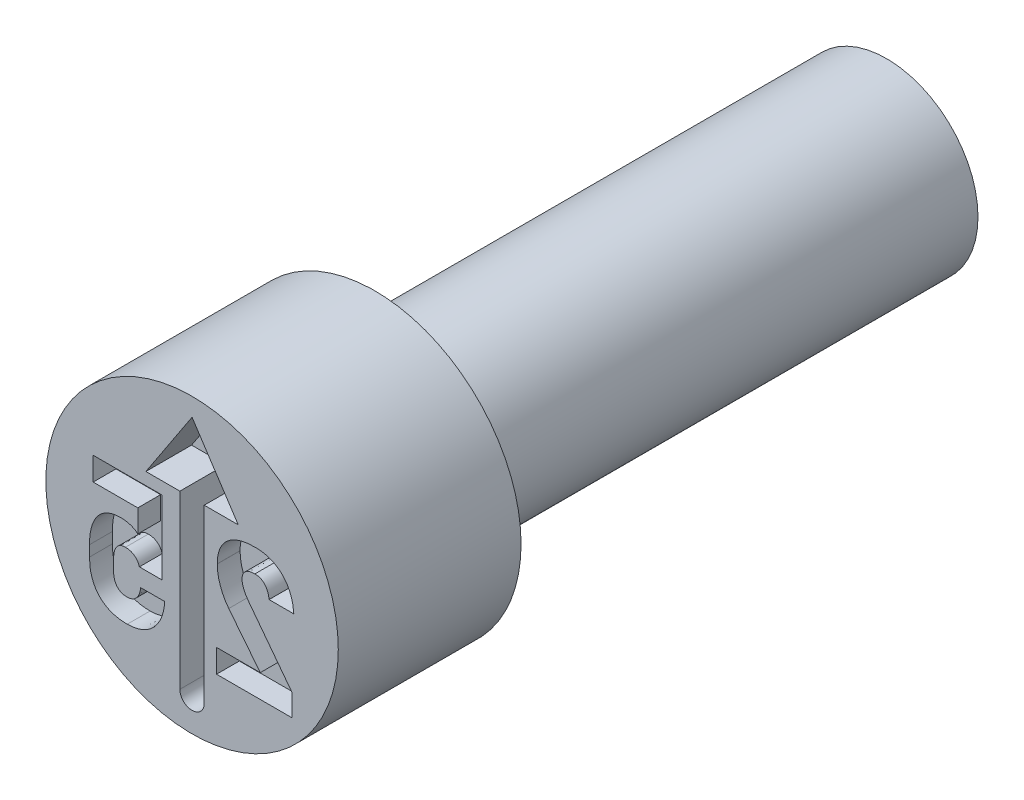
ISO-10303-21;
HEADER;
FILE_DESCRIPTION(('STEP AP214'),'2;1');
FILE_NAME('part.step','',(''),(''),'','','');
FILE_SCHEMA(('AUTOMOTIVE_DESIGN { 1 0 10303 214 1 1 1 1 }'));
ENDSEC;
DATA;
#1=APPLICATION_CONTEXT('core data for automotive mechanical design processes');
#2=APPLICATION_PROTOCOL_DEFINITION('international standard','automotive_design',2000,#1);
#3=PRODUCT_CONTEXT('',#1,'mechanical');
#4=PRODUCT('Part','Part','',(#3));
#5=PRODUCT_RELATED_PRODUCT_CATEGORY('part','',(#4));
#6=PRODUCT_DEFINITION_FORMATION('','',#4);
#7=PRODUCT_DEFINITION_CONTEXT('part definition',#1,'design');
#8=PRODUCT_DEFINITION('design','',#6,#7);
#9=PRODUCT_DEFINITION_SHAPE('','',#8);
#10=(LENGTH_UNIT() NAMED_UNIT(*) SI_UNIT(.MILLI.,.METRE.));
#11=(NAMED_UNIT(*) PLANE_ANGLE_UNIT() SI_UNIT($,.RADIAN.));
#12=(NAMED_UNIT(*) SI_UNIT($,.STERADIAN.) SOLID_ANGLE_UNIT());
#13=UNCERTAINTY_MEASURE_WITH_UNIT(LENGTH_MEASURE(1.E-05),#10,'distance_accuracy_value','');
#14=(GEOMETRIC_REPRESENTATION_CONTEXT(3) GLOBAL_UNCERTAINTY_ASSIGNED_CONTEXT((#13)) GLOBAL_UNIT_ASSIGNED_CONTEXT((#10,
#11,#12)) REPRESENTATION_CONTEXT('',''));
#15=CARTESIAN_POINT('',(0.,0.,0.));
#16=DIRECTION('',(0.,0.,1.));
#17=DIRECTION('',(1.,0.,0.));
#18=AXIS2_PLACEMENT_3D('',#15,#16,#17);
#19=CARTESIAN_POINT('',(0.,0.499999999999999,-1.));
#20=DIRECTION('',(0.,0.,1.));
#21=DIRECTION('',(1.,0.,0.));
#22=AXIS2_PLACEMENT_3D('',#19,#20,#21);
#23=PLANE('',#22);
#24=CARTESIAN_POINT('',(0.,0.,-1.));
#25=DIRECTION('',(0.,0.,1.));
#26=DIRECTION('',(1.,0.,0.));
#27=AXIS2_PLACEMENT_3D('',#24,#25,#26);
#28=CIRCLE('',#27,0.8);
#29=CARTESIAN_POINT('',(0.8,0.,-1.));
#30=VERTEX_POINT('',#29);
#31=EDGE_CURVE('E11',#30,#30,#28,.T.);
#32=ORIENTED_EDGE('',*,*,#31,.F.);
#33=EDGE_LOOP('',(#32));
#34=FACE_BOUND('',#33,.T.);
#35=CARTESIAN_POINT('',(0.,0.,-1.));
#36=DIRECTION('',(0.,0.,1.));
#37=DIRECTION('',(1.,0.,0.));
#38=AXIS2_PLACEMENT_3D('',#35,#36,#37);
#39=CIRCLE('',#38,0.499999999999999);
#40=CARTESIAN_POINT('',(0.499999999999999,0.,-1.));
#41=VERTEX_POINT('',#40);
#42=EDGE_CURVE('E562',#41,#41,#39,.T.);
#43=ORIENTED_EDGE('',*,*,#42,.T.);
#44=EDGE_LOOP('',(#43));
#45=FACE_BOUND('',#44,.T.);
#46=ADVANCED_FACE('F34',(#34,#45),#23,.F.);
#47=CARTESIAN_POINT('',(0.,0.,-0.403888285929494));
#48=DIRECTION('',(0.,0.,1.));
#49=DIRECTION('',(1.,0.,0.));
#50=AXIS2_PLACEMENT_3D('',#47,#48,#49);
#51=CYLINDRICAL_SURFACE('',#50,0.8);
#52=CARTESIAN_POINT('',(0.,0.,0.));
#53=DIRECTION('',(0.,0.,1.));
#54=DIRECTION('',(1.,0.,0.));
#55=AXIS2_PLACEMENT_3D('',#52,#53,#54);
#56=CIRCLE('',#55,0.8);
#57=CARTESIAN_POINT('',(0.8,0.,0.));
#58=VERTEX_POINT('',#57);
#59=EDGE_CURVE('E41',#58,#58,#56,.T.);
#60=ORIENTED_EDGE('',*,*,#59,.F.);
#61=EDGE_LOOP('',(#60));
#62=FACE_BOUND('',#61,.T.);
#63=ORIENTED_EDGE('',*,*,#31,.T.);
#64=EDGE_LOOP('',(#63));
#65=FACE_BOUND('',#64,.T.);
#66=ADVANCED_FACE('F584',(#62,#65),#51,.T.);
#67=CARTESIAN_POINT('',(0.,0.8,0.));
#68=DIRECTION('',(0.,0.,-1.));
#69=DIRECTION('',(-1.,0.,0.));
#70=AXIS2_PLACEMENT_3D('',#67,#68,#69);
#71=PLANE('',#70);
#72=CARTESIAN_POINT('',(-0.354687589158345,-0.457275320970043,0.));
#73=CARTESIAN_POINT('',(-0.345487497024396,-0.456994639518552,0.));
#74=CARTESIAN_POINT('',(-0.327484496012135,-0.456445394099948,0.));
#75=CARTESIAN_POINT('',(-0.301242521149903,-0.451514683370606,0.));
#76=CARTESIAN_POINT('',(-0.276364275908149,-0.443878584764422,0.));
#77=CARTESIAN_POINT('',(-0.253034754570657,-0.432985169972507,0.));
#78=CARTESIAN_POINT('',(-0.231507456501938,-0.419145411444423,0.));
#79=CARTESIAN_POINT('',(-0.212258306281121,-0.402221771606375,0.));
#80=CARTESIAN_POINT('',(-0.195110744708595,-0.382657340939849,0.));
#81=CARTESIAN_POINT('',(-0.180408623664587,-0.360280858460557,0.));
#82=CARTESIAN_POINT('',(-0.168300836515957,-0.335331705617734,0.));
#83=CARTESIAN_POINT('',(-0.158874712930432,-0.3081039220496,0.));
#84=CARTESIAN_POINT('',(-0.152400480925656,-0.278646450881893,0.));
#85=CARTESIAN_POINT('',(-0.150518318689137,-0.258209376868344,0.));
#86=CARTESIAN_POINT('',(-0.149552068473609,-0.24771754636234,0.));
#87=B_SPLINE_CURVE_WITH_KNOTS('',3,(#72,#73,#74,#75,#76,#77,#78,#79,#80,#81,#82,#83,#84,#85,
#86),.UNSPECIFIED.,.F.,.F.,(4,1,1,1,1,1,1,1,1,1,1,1,4),(0.,0.0844304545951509,0.165215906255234,
0.244369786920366,0.322918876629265,0.400936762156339,0.478631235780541,0.557558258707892,
0.639203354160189,0.723781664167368,0.811629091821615,0.903295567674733,1.),.UNSPECIFIED.);
#88=CARTESIAN_POINT('',(-0.354687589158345,-0.457275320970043,0.));
#89=VERTEX_POINT('',#88);
#90=CARTESIAN_POINT('',(-0.149552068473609,-0.24771754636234,0.));
#91=VERTEX_POINT('',#90);
#92=EDGE_CURVE('E856',#89,#91,#87,.T.);
#93=ORIENTED_EDGE('',*,*,#92,.F.);
#94=CARTESIAN_POINT('',(-0.561106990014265,-0.24243937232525,0.));
#95=CARTESIAN_POINT('',(-0.56079449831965,-0.253341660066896,0.));
#96=CARTESIAN_POINT('',(-0.560189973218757,-0.274432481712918,0.));
#97=CARTESIAN_POINT('',(-0.555866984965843,-0.30493132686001,0.));
#98=CARTESIAN_POINT('',(-0.548073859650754,-0.332907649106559,0.));
#99=CARTESIAN_POINT('',(-0.537632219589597,-0.358542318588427,0.));
#100=CARTESIAN_POINT('',(-0.523997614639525,-0.381325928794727,0.));
#101=CARTESIAN_POINT('',(-0.50767098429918,-0.401450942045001,0.));
#102=CARTESIAN_POINT('',(-0.488354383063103,-0.418452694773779,0.));
#103=CARTESIAN_POINT('',(-0.466503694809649,-0.4327611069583,0.));
#104=CARTESIAN_POINT('',(-0.441911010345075,-0.443734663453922,0.));
#105=CARTESIAN_POINT('',(-0.414969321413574,-0.45170659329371,0.));
#106=CARTESIAN_POINT('',(-0.38557201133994,-0.456448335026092,0.));
#107=CARTESIAN_POINT('',(-0.36521426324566,-0.456993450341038,0.));
#108=CARTESIAN_POINT('',(-0.354687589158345,-0.457275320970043,0.));
#109=B_SPLINE_CURVE_WITH_KNOTS('',3,(#94,#95,#96,#97,#98,#99,#100,#101,#102,#103,#104,#105,#106,
#107,#108),.UNSPECIFIED.,.F.,.F.,(4,1,1,1,1,1,1,1,1,1,1,1,4),(0.,0.0965919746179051,
0.1868602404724,0.272108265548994,0.35332451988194,0.431359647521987,0.506505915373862,
0.582010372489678,0.6584354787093,0.737063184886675,0.819709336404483,0.906774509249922,1.),.UNSPECIFIED.);
#110=CARTESIAN_POINT('',(-0.561106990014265,-0.24243937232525,0.));
#111=VERTEX_POINT('',#110);
#112=EDGE_CURVE('E48',#111,#89,#109,.T.);
#113=ORIENTED_EDGE('',*,*,#112,.F.);
#114=DIRECTION('',(0.,-1.,0.));
#115=VECTOR('',#114,1.);
#116=CARTESIAN_POINT('',(-0.561106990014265,-0.183808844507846,0.));
#117=LINE('',#116,#115);
#118=CARTESIAN_POINT('',(-0.561106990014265,-0.183808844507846,0.));
#119=VERTEX_POINT('',#118);
#120=EDGE_CURVE('E329',#119,#111,#117,.T.);
#121=ORIENTED_EDGE('',*,*,#120,.F.);
#122=CARTESIAN_POINT('',(-0.388781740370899,0.0304564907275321,0.));
#123=CARTESIAN_POINT('',(-0.397554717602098,0.030178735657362,0.));
#124=CARTESIAN_POINT('',(-0.414569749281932,0.0296400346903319,0.));
#125=CARTESIAN_POINT('',(-0.439112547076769,0.0247942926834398,0.));
#126=CARTESIAN_POINT('',(-0.461731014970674,0.0170309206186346,0.));
#127=CARTESIAN_POINT('',(-0.482238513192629,0.00584614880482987,0.));
#128=CARTESIAN_POINT('',(-0.500658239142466,-0.00817226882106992,0.));
#129=CARTESIAN_POINT('',(-0.516657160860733,-0.0253016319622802,0.));
#130=CARTESIAN_POINT('',(-0.53033501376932,-0.0452627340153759,0.));
#131=CARTESIAN_POINT('',(-0.541529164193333,-0.0680689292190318,0.));
#132=CARTESIAN_POINT('',(-0.550339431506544,-0.0935203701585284,0.));
#133=CARTESIAN_POINT('',(-0.556738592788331,-0.121439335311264,0.));
#134=CARTESIAN_POINT('',(-0.560385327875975,-0.151852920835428,0.));
#135=CARTESIAN_POINT('',(-0.56086085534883,-0.172909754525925,0.));
#136=CARTESIAN_POINT('',(-0.561106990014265,-0.183808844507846,0.));
#137=B_SPLINE_CURVE_WITH_KNOTS('',3,(#122,#123,#124,#125,#126,#127,#128,#129,#130,#131,#132,
#133,#134,#135,#136),.UNSPECIFIED.,.F.,.F.,(4,1,1,1,1,1,1,1,1,1,1,1,4),(0.,0.084394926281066,
0.163682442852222,0.239848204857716,0.313806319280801,0.3876154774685,0.461788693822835,
0.538496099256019,0.61978489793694,0.70565234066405,0.797279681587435,0.895071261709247,1.),.UNSPECIFIED.);
#138=CARTESIAN_POINT('',(-0.388781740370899,0.0304564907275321,0.));
#139=VERTEX_POINT('',#138);
#140=EDGE_CURVE('E332',#139,#119,#137,.T.);
#141=ORIENTED_EDGE('',*,*,#140,.F.);
#142=CARTESIAN_POINT('',(-0.296912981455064,-0.000784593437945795,0.));
#143=CARTESIAN_POINT('',(-0.299568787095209,0.00156705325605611,0.));
#144=CARTESIAN_POINT('',(-0.305031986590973,0.00640457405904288,0.));
#145=CARTESIAN_POINT('',(-0.314583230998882,0.0125468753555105,0.));
#146=CARTESIAN_POINT('',(-0.325506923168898,0.017763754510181,0.));
#147=CARTESIAN_POINT('',(-0.341625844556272,0.0237721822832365,0.));
#148=CARTESIAN_POINT('',(-0.362829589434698,0.0291151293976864,0.));
#149=CARTESIAN_POINT('',(-0.380236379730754,0.0300148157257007,0.));
#150=CARTESIAN_POINT('',(-0.388781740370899,0.0304564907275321,0.));
#151=B_SPLINE_CURVE_WITH_KNOTS('',3,(#142,#143,#144,#145,#146,#147,#148,#149,#150),
.UNSPECIFIED.,.F.,.F.,(4,1,1,1,1,1,4),(0.,0.10729164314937,0.220707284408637,0.342410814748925,
0.473179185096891,0.74137254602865,1.),.UNSPECIFIED.);
#152=CARTESIAN_POINT('',(-0.296912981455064,-0.000784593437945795,0.));
#153=VERTEX_POINT('',#152);
#154=EDGE_CURVE('E783',#153,#139,#151,.T.);
#155=ORIENTED_EDGE('',*,*,#154,.F.);
#156=DIRECTION('',(0.,-1.,0.));
#157=VECTOR('',#156,1.);
#158=CARTESIAN_POINT('',(-0.296912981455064,0.122895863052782,0.));
#159=LINE('',#158,#157);
#160=CARTESIAN_POINT('',(-0.296912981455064,0.122895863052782,0.));
#161=VERTEX_POINT('',#160);
#162=EDGE_CURVE('E791',#161,#153,#159,.T.);
#163=ORIENTED_EDGE('',*,*,#162,.F.);
#164=DIRECTION('',(1.,0.,0.));
#165=VECTOR('',#164,1.);
#166=CARTESIAN_POINT('',(-0.540992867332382,0.122895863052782,0.));
#167=LINE('',#166,#165);
#168=CARTESIAN_POINT('',(-0.540992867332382,0.122895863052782,0.));
#169=VERTEX_POINT('',#168);
#170=EDGE_CURVE('E797',#169,#161,#167,.T.);
#171=ORIENTED_EDGE('',*,*,#170,.F.);
#172=DIRECTION('',(0.,-1.,0.));
#173=VECTOR('',#172,1.);
#174=CARTESIAN_POINT('',(-0.540992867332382,0.25,0.));
#175=LINE('',#174,#173);
#176=CARTESIAN_POINT('',(-0.540992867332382,0.25,0.));
#177=VERTEX_POINT('',#176);
#178=EDGE_CURVE('E800',#177,#169,#175,.T.);
#179=ORIENTED_EDGE('',*,*,#178,.F.);
#180=DIRECTION('',(-1.,0.,0.));
#181=VECTOR('',#180,1.);
#182=CARTESIAN_POINT('',(-0.164958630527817,0.25,0.));
#183=LINE('',#182,#181);
#184=CARTESIAN_POINT('',(-0.164958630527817,0.25,0.));
#185=VERTEX_POINT('',#184);
#186=EDGE_CURVE('E803',#185,#177,#183,.T.);
#187=ORIENTED_EDGE('',*,*,#186,.F.);
#188=DIRECTION('',(0.,1.,0.));
#189=VECTOR('',#188,1.);
#190=CARTESIAN_POINT('',(-0.164958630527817,-0.152425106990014,0.));
#191=LINE('',#190,#189);
#192=CARTESIAN_POINT('',(-0.164958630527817,-0.152425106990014,0.));
#193=VERTEX_POINT('',#192);
#194=EDGE_CURVE('E806',#193,#185,#191,.T.);
#195=ORIENTED_EDGE('',*,*,#194,.F.);
#196=DIRECTION('',(1.,0.,0.));
#197=VECTOR('',#196,1.);
#198=CARTESIAN_POINT('',(-0.288211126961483,-0.152425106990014,0.));
#199=LINE('',#198,#197);
#200=CARTESIAN_POINT('',(-0.288211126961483,-0.152425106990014,0.));
#201=VERTEX_POINT('',#200);
#202=EDGE_CURVE('E809',#201,#193,#199,.T.);
#203=ORIENTED_EDGE('',*,*,#202,.F.);
#204=CARTESIAN_POINT('',(-0.364245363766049,-0.0975035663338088,0.));
#205=CARTESIAN_POINT('',(-0.359665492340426,-0.097643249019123,0.));
#206=CARTESIAN_POINT('',(-0.35079903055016,-0.0979136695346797,0.));
#207=CARTESIAN_POINT('',(-0.338032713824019,-0.100713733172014,0.));
#208=CARTESIAN_POINT('',(-0.326299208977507,-0.105295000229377,0.));
#209=CARTESIAN_POINT('',(-0.31573171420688,-0.111772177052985,0.));
#210=CARTESIAN_POINT('',(-0.306398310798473,-0.119710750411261,0.));
#211=CARTESIAN_POINT('',(-0.298713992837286,-0.129303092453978,0.));
#212=CARTESIAN_POINT('',(-0.292272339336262,-0.14014190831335,0.));
#213=CARTESIAN_POINT('',(-0.289584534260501,-0.148271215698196,0.));
#214=CARTESIAN_POINT('',(-0.288211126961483,-0.152425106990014,0.));
#215=B_SPLINE_CURVE_WITH_KNOTS('',3,(#204,#205,#206,#207,#208,#209,#210,#211,#212,#213,#214),
.UNSPECIFIED.,.F.,.F.,(4,1,1,1,1,1,1,1,4),(0.,0.135635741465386,0.262585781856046,
0.385395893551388,0.507524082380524,0.628507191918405,0.746772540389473,0.870606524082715,1.),.UNSPECIFIED.);
#216=CARTESIAN_POINT('',(-0.364245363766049,-0.0975035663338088,0.));
#217=VERTEX_POINT('',#216);
#218=EDGE_CURVE('E812',#217,#201,#215,.T.);
#219=ORIENTED_EDGE('',*,*,#218,.F.);
#220=CARTESIAN_POINT('',(-0.429295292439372,-0.183808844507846,0.));
#221=CARTESIAN_POINT('',(-0.429154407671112,-0.177276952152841,0.));
#222=CARTESIAN_POINT('',(-0.428887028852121,-0.164880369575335,0.));
#223=CARTESIAN_POINT('',(-0.42556084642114,-0.147539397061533,0.));
#224=CARTESIAN_POINT('',(-0.420389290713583,-0.132409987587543,0.));
#225=CARTESIAN_POINT('',(-0.412751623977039,-0.119850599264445,0.));
#226=CARTESIAN_POINT('',(-0.403257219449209,-0.109713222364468,0.));
#227=CARTESIAN_POINT('',(-0.391767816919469,-0.102513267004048,0.));
#228=CARTESIAN_POINT('',(-0.378514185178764,-0.0982608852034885,0.));
#229=CARTESIAN_POINT('',(-0.369127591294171,-0.0977626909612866,0.));
#230=CARTESIAN_POINT('',(-0.364245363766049,-0.0975035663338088,0.));
#231=B_SPLINE_CURVE_WITH_KNOTS('',3,(#220,#221,#222,#223,#224,#225,#226,#227,#228,#229,#230),
.UNSPECIFIED.,.F.,.F.,(4,1,1,1,1,1,1,1,4),(0.,0.160198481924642,0.304033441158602,
0.431843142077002,0.550810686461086,0.662316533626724,0.769888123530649,0.880312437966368,1.),.UNSPECIFIED.);
#232=CARTESIAN_POINT('',(-0.429295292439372,-0.183808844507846,0.));
#233=VERTEX_POINT('',#232);
#234=EDGE_CURVE('E817',#233,#217,#231,.T.);
#235=ORIENTED_EDGE('',*,*,#234,.F.);
#236=DIRECTION('',(0.,1.,0.));
#237=VECTOR('',#236,1.);
#238=CARTESIAN_POINT('',(-0.429295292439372,-0.24243937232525,0.));
#239=LINE('',#238,#237);
#240=CARTESIAN_POINT('',(-0.429295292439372,-0.24243937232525,0.));
#241=VERTEX_POINT('',#240);
#242=EDGE_CURVE('E825',#241,#233,#239,.T.);
#243=ORIENTED_EDGE('',*,*,#242,.F.);
#244=CARTESIAN_POINT('',(-0.356542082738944,-0.329172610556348,0.));
#245=CARTESIAN_POINT('',(-0.362043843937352,-0.328932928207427,0.));
#246=CARTESIAN_POINT('',(-0.372567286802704,-0.328474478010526,0.));
#247=CARTESIAN_POINT('',(-0.387317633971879,-0.32404976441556,0.));
#248=CARTESIAN_POINT('',(-0.400158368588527,-0.316965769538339,0.));
#249=CARTESIAN_POINT('',(-0.410764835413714,-0.306772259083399,0.));
#250=CARTESIAN_POINT('',(-0.419226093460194,-0.294071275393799,0.));
#251=CARTESIAN_POINT('',(-0.425215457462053,-0.278861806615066,0.));
#252=CARTESIAN_POINT('',(-0.428762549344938,-0.261385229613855,0.));
#253=CARTESIAN_POINT('',(-0.429111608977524,-0.248971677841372,0.));
#254=CARTESIAN_POINT('',(-0.429295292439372,-0.24243937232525,0.));
#255=B_SPLINE_CURVE_WITH_KNOTS('',3,(#244,#245,#246,#247,#248,#249,#250,#251,#252,#253,#254),
.UNSPECIFIED.,.F.,.F.,(4,1,1,1,1,1,1,1,4),(0.,0.128261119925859,0.245330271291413,
0.356275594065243,0.467886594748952,0.585607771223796,0.710231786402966,0.847517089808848,1.),.UNSPECIFIED.);
#256=CARTESIAN_POINT('',(-0.356542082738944,-0.329172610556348,0.));
#257=VERTEX_POINT('',#256);
#258=EDGE_CURVE('E831',#257,#241,#255,.T.);
#259=ORIENTED_EDGE('',*,*,#258,.F.);
#260=CARTESIAN_POINT('',(-0.281506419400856,-0.24771754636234,0.));
#261=CARTESIAN_POINT('',(-0.282259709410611,-0.253844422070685,0.));
#262=CARTESIAN_POINT('',(-0.283695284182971,-0.265520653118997,0.));
#263=CARTESIAN_POINT('',(-0.288871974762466,-0.281723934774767,0.));
#264=CARTESIAN_POINT('',(-0.295630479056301,-0.295966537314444,0.));
#265=CARTESIAN_POINT('',(-0.304557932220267,-0.307917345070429,0.));
#266=CARTESIAN_POINT('',(-0.315159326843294,-0.317619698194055,0.));
#267=CARTESIAN_POINT('',(-0.327721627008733,-0.324200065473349,0.));
#268=CARTESIAN_POINT('',(-0.341605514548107,-0.328591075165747,0.));
#269=CARTESIAN_POINT('',(-0.351466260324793,-0.328974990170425,0.));
#270=CARTESIAN_POINT('',(-0.356542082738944,-0.329172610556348,0.));
#271=B_SPLINE_CURVE_WITH_KNOTS('',3,(#260,#261,#262,#263,#264,#265,#266,#267,#268,#269,#270),
.UNSPECIFIED.,.F.,.F.,(4,1,1,1,1,1,1,1,4),(0.,0.150277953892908,0.286390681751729,
0.412971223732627,0.533144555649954,0.648163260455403,0.760273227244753,0.876600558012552,1.),.UNSPECIFIED.);
#272=CARTESIAN_POINT('',(-0.281506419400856,-0.24771754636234,0.));
#273=VERTEX_POINT('',#272);
#274=EDGE_CURVE('E836',#273,#257,#271,.T.);
#275=ORIENTED_EDGE('',*,*,#274,.F.);
#276=DIRECTION('',(0.,-1.,0.));
#277=VECTOR('',#276,1.);
#278=CARTESIAN_POINT('',(-0.281506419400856,-0.247289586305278,0.));
#279=LINE('',#278,#277);
#280=CARTESIAN_POINT('',(-0.281506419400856,-0.247289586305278,0.));
#281=VERTEX_POINT('',#280);
#282=EDGE_CURVE('E844',#281,#273,#279,.T.);
#283=ORIENTED_EDGE('',*,*,#282,.F.);
#284=DIRECTION('',(-1.,0.,0.));
#285=VECTOR('',#284,1.);
#286=CARTESIAN_POINT('',(-0.149552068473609,-0.247289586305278,0.));
#287=LINE('',#286,#285);
#288=CARTESIAN_POINT('',(-0.149552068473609,-0.247289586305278,0.));
#289=VERTEX_POINT('',#288);
#290=EDGE_CURVE('E850',#289,#281,#287,.T.);
#291=ORIENTED_EDGE('',*,*,#290,.F.);
#292=DIRECTION('',(0.,1.,0.));
#293=VECTOR('',#292,1.);
#294=CARTESIAN_POINT('',(-0.149552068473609,-0.24771754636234,0.));
#295=LINE('',#294,#293);
#296=EDGE_CURVE('E853',#91,#289,#295,.T.);
#297=ORIENTED_EDGE('',*,*,#296,.F.);
#298=EDGE_LOOP('',(#93,#113,#121,#141,#155,#163,#171,#179,#187,#195,#203,#219,#235,#243,#259,
#275,#283,#291,#297));
#299=FACE_BOUND('',#298,.T.);
#300=DIRECTION('',(-0.60539313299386,0.795926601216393,0.));
#301=VECTOR('',#300,1.);
#302=CARTESIAN_POINT('',(0.54793152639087,-0.331027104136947,0.));
#303=LINE('',#302,#301);
#304=CARTESIAN_POINT('',(0.54793152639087,-0.331027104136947,0.));
#305=VERTEX_POINT('',#304);
#306=CARTESIAN_POINT('',(0.307703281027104,-0.0151925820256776,0.));
#307=VERTEX_POINT('',#306);
#308=EDGE_CURVE('E405',#305,#307,#303,.T.);
#309=ORIENTED_EDGE('',*,*,#308,.F.);
#310=DIRECTION('',(0.,1.,0.));
#311=VECTOR('',#310,1.);
#312=CARTESIAN_POINT('',(0.54793152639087,-0.45,0.));
#313=LINE('',#312,#311);
#314=CARTESIAN_POINT('',(0.54793152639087,-0.45,0.));
#315=VERTEX_POINT('',#314);
#316=EDGE_CURVE('E56',#315,#305,#313,.T.);
#317=ORIENTED_EDGE('',*,*,#316,.F.);
#318=DIRECTION('',(1.,0.,0.));
#319=VECTOR('',#318,1.);
#320=CARTESIAN_POINT('',(0.1339514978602,-0.45,0.));
#321=LINE('',#320,#319);
#322=CARTESIAN_POINT('',(0.1339514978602,-0.45,0.));
#323=VERTEX_POINT('',#322);
#324=EDGE_CURVE('E481',#323,#315,#321,.T.);
#325=ORIENTED_EDGE('',*,*,#324,.F.);
#326=DIRECTION('',(0.,-1.,0.));
#327=VECTOR('',#326,1.);
#328=CARTESIAN_POINT('',(0.1339514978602,-0.322895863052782,0.));
#329=LINE('',#328,#327);
#330=CARTESIAN_POINT('',(0.1339514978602,-0.322895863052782,0.));
#331=VERTEX_POINT('',#330);
#332=EDGE_CURVE('E478',#331,#323,#329,.T.);
#333=ORIENTED_EDGE('',*,*,#332,.F.);
#334=DIRECTION('',(-1.,0.,0.));
#335=VECTOR('',#334,1.);
#336=CARTESIAN_POINT('',(0.373181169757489,-0.322895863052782,0.));
#337=LINE('',#336,#335);
#338=CARTESIAN_POINT('',(0.373181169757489,-0.322895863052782,0.));
#339=VERTEX_POINT('',#338);
#340=EDGE_CURVE('E475',#339,#331,#337,.T.);
#341=ORIENTED_EDGE('',*,*,#340,.F.);
#342=DIRECTION('',(0.620676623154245,-0.78406666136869,0.));
#343=VECTOR('',#342,1.);
#344=CARTESIAN_POINT('',(0.200855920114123,-0.105206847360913,0.));
#345=LINE('',#344,#343);
#346=CARTESIAN_POINT('',(0.200855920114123,-0.105206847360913,0.));
#347=VERTEX_POINT('',#346);
#348=EDGE_CURVE('E469',#347,#339,#345,.T.);
#349=ORIENTED_EDGE('',*,*,#348,.F.);
#350=CARTESIAN_POINT('',(0.137803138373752,0.0742510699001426,0.));
#351=CARTESIAN_POINT('',(0.137986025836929,0.0663000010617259,0.));
#352=CARTESIAN_POINT('',(0.138352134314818,0.0503833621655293,0.));
#353=CARTESIAN_POINT('',(0.14161734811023,0.026604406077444,0.));
#354=CARTESIAN_POINT('',(0.14695645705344,0.00296284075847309,0.));
#355=CARTESIAN_POINT('',(0.154200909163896,-0.0204584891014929,0.));
#356=CARTESIAN_POINT('',(0.163247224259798,-0.0432684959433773,0.));
#357=CARTESIAN_POINT('',(0.174043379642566,-0.0651037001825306,0.));
#358=CARTESIAN_POINT('',(0.1863693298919,-0.0859083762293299,0.));
#359=CARTESIAN_POINT('',(0.196027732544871,-0.0987749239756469,0.));
#360=CARTESIAN_POINT('',(0.200855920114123,-0.105206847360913,0.));
#361=B_SPLINE_CURVE_WITH_KNOTS('',3,(#350,#351,#352,#353,#354,#355,#356,#357,#358,#359,#360),
.UNSPECIFIED.,.F.,.F.,(4,1,1,1,1,1,1,1,4),(0.,0.123148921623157,0.246522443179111,
0.371108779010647,0.498350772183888,0.625999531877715,0.750879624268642,0.875465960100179,1.),.UNSPECIFIED.);
#362=CARTESIAN_POINT('',(0.137803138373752,0.0742510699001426,0.));
#363=VERTEX_POINT('',#362);
#364=EDGE_CURVE('E464',#363,#347,#361,.T.);
#365=ORIENTED_EDGE('',*,*,#364,.F.);
#366=DIRECTION('',(0.,-1.,0.));
#367=VECTOR('',#366,1.);
#368=CARTESIAN_POINT('',(0.137803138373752,0.0748216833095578,0.));
#369=LINE('',#368,#367);
#370=CARTESIAN_POINT('',(0.137803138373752,0.0748216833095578,0.));
#371=VERTEX_POINT('',#370);
#372=EDGE_CURVE('E458',#371,#363,#369,.T.);
#373=ORIENTED_EDGE('',*,*,#372,.F.);
#374=CARTESIAN_POINT('',(0.344793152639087,0.257275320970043,0.));
#375=CARTESIAN_POINT('',(0.334271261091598,0.257055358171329,0.));
#376=CARTESIAN_POINT('',(0.31390678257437,0.256629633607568,0.));
#377=CARTESIAN_POINT('',(0.284583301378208,0.252621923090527,0.));
#378=CARTESIAN_POINT('',(0.257619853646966,0.245952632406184,0.));
#379=CARTESIAN_POINT('',(0.233084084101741,0.236582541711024,0.));
#380=CARTESIAN_POINT('',(0.211137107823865,0.224537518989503,0.));
#381=CARTESIAN_POINT('',(0.191677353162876,0.210240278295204,0.));
#382=CARTESIAN_POINT('',(0.175254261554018,0.193135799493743,0.));
#383=CARTESIAN_POINT('',(0.161593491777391,0.173704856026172,0.));
#384=CARTESIAN_POINT('',(0.15082461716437,0.152022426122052,0.));
#385=CARTESIAN_POINT('',(0.143283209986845,0.128107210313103,0.));
#386=CARTESIAN_POINT('',(0.138664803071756,0.102151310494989,0.));
#387=CARTESIAN_POINT('',(0.13809611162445,0.0841139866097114,0.));
#388=CARTESIAN_POINT('',(0.137803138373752,0.0748216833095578,0.));
#389=B_SPLINE_CURVE_WITH_KNOTS('',3,(#374,#375,#376,#377,#378,#379,#380,#381,#382,#383,#384,
#385,#386,#387,#388),.UNSPECIFIED.,.F.,.F.,(4,1,1,1,1,1,1,1,1,1,1,1,4),(0.,0.100715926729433,
0.194929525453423,0.2827284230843,0.366191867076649,0.44566981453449,0.521804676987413,
0.596515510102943,0.671682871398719,0.748455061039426,0.827368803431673,0.911065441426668,1.),.UNSPECIFIED.);
#390=CARTESIAN_POINT('',(0.344793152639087,0.257275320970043,0.));
#391=VERTEX_POINT('',#390);
#392=EDGE_CURVE('E450',#391,#371,#389,.T.);
#393=ORIENTED_EDGE('',*,*,#392,.F.);
#394=CARTESIAN_POINT('',(0.556633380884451,0.0478601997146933,0.));
#395=CARTESIAN_POINT('',(0.555664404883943,0.0583985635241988,0.));
#396=CARTESIAN_POINT('',(0.553776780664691,0.078927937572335,0.));
#397=CARTESIAN_POINT('',(0.547358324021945,0.108450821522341,0.));
#398=CARTESIAN_POINT('',(0.537876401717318,0.135616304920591,0.));
#399=CARTESIAN_POINT('',(0.525761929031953,0.160499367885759,0.));
#400=CARTESIAN_POINT('',(0.510907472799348,0.182785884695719,0.));
#401=CARTESIAN_POINT('',(0.493671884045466,0.202469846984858,0.));
#402=CARTESIAN_POINT('',(0.473864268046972,0.219168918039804,0.));
#403=CARTESIAN_POINT('',(0.451827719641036,0.233045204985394,0.));
#404=CARTESIAN_POINT('',(0.427658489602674,0.243904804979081,0.));
#405=CARTESIAN_POINT('',(0.401652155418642,0.251817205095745,0.));
#406=CARTESIAN_POINT('',(0.373769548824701,0.256378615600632,0.));
#407=CARTESIAN_POINT('',(0.354605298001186,0.256971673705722,0.));
#408=CARTESIAN_POINT('',(0.344793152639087,0.257275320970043,0.));
#409=B_SPLINE_CURVE_WITH_KNOTS('',3,(#394,#395,#396,#397,#398,#399,#400,#401,#402,#403,#404,
#405,#406,#407,#408),.UNSPECIFIED.,.F.,.F.,(4,1,1,1,1,1,1,1,1,1,1,1,4),(0.,0.0953291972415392,
0.185707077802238,0.271513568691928,0.35413169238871,0.434493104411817,0.512233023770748,
0.58917600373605,0.667186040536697,0.746219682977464,0.827302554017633,0.911578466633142,1.),.UNSPECIFIED.);
#410=CARTESIAN_POINT('',(0.556633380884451,0.0478601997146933,0.));
#411=VERTEX_POINT('',#410);
#412=EDGE_CURVE('E445',#411,#391,#409,.T.);
#413=ORIENTED_EDGE('',*,*,#412,.F.);
#414=DIRECTION('',(0.,1.,0.));
#415=VECTOR('',#414,1.);
#416=CARTESIAN_POINT('',(0.556633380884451,0.0472895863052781,0.));
#417=LINE('',#416,#415);
#418=CARTESIAN_POINT('',(0.556633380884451,0.0472895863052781,0.));
#419=VERTEX_POINT('',#418);
#420=EDGE_CURVE('E442',#419,#411,#417,.T.);
#421=ORIENTED_EDGE('',*,*,#420,.F.);
#422=DIRECTION('',(1.,0.,0.));
#423=VECTOR('',#422,1.);
#424=CARTESIAN_POINT('',(0.421398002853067,0.0472895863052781,0.));
#425=LINE('',#424,#423);
#426=CARTESIAN_POINT('',(0.421398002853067,0.0472895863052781,0.));
#427=VERTEX_POINT('',#426);
#428=EDGE_CURVE('E439',#427,#419,#425,.T.);
#429=ORIENTED_EDGE('',*,*,#428,.F.);
#430=DIRECTION('',(0.,-1.,0.));
#431=VECTOR('',#430,1.);
#432=CARTESIAN_POINT('',(0.421398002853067,0.0478601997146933,0.));
#433=LINE('',#432,#431);
#434=CARTESIAN_POINT('',(0.421398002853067,0.0478601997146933,0.));
#435=VERTEX_POINT('',#434);
#436=EDGE_CURVE('E433',#435,#427,#433,.T.);
#437=ORIENTED_EDGE('',*,*,#436,.F.);
#438=CARTESIAN_POINT('',(0.343794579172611,0.130171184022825,0.));
#439=CARTESIAN_POINT('',(0.349004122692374,0.129951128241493,0.));
#440=CARTESIAN_POINT('',(0.359114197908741,0.129524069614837,0.));
#441=CARTESIAN_POINT('',(0.373495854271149,0.125454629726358,0.));
#442=CARTESIAN_POINT('',(0.386271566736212,0.11854588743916,0.));
#443=CARTESIAN_POINT('',(0.397331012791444,0.10899784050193,0.));
#444=CARTESIAN_POINT('',(0.406610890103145,0.0969863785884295,0.));
#445=CARTESIAN_POINT('',(0.413450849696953,0.0825164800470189,0.));
#446=CARTESIAN_POINT('',(0.41895918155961,0.0660708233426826,0.));
#447=CARTESIAN_POINT('',(0.420557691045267,0.0541347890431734,0.));
#448=CARTESIAN_POINT('',(0.421398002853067,0.0478601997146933,0.));
#449=B_SPLINE_CURVE_WITH_KNOTS('',3,(#438,#439,#440,#441,#442,#443,#444,#445,#446,#447,#448),
.UNSPECIFIED.,.F.,.F.,(4,1,1,1,1,1,1,1,4),(0.,0.124212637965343,0.241057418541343,
0.353359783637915,0.468536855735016,0.587568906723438,0.713021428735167,0.849139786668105,1.),.UNSPECIFIED.);
#450=CARTESIAN_POINT('',(0.343794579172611,0.130171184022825,0.));
#451=VERTEX_POINT('',#450);
#452=EDGE_CURVE('E425',#451,#435,#449,.T.);
#453=ORIENTED_EDGE('',*,*,#452,.F.);
#454=CARTESIAN_POINT('',(0.273609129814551,0.0709700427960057,0.));
#455=CARTESIAN_POINT('',(0.273800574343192,0.0754649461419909,0.));
#456=CARTESIAN_POINT('',(0.274165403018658,0.084030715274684,0.));
#457=CARTESIAN_POINT('',(0.277687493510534,0.0960818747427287,0.));
#458=CARTESIAN_POINT('',(0.283511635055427,0.106502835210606,0.));
#459=CARTESIAN_POINT('',(0.29166967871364,0.115238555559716,0.));
#460=CARTESIAN_POINT('',(0.302046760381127,0.121952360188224,0.));
#461=CARTESIAN_POINT('',(0.31428718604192,0.126856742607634,0.));
#462=CARTESIAN_POINT('',(0.328456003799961,0.129631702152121,0.));
#463=CARTESIAN_POINT('',(0.338504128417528,0.129985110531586,0.));
#464=CARTESIAN_POINT('',(0.343794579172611,0.130171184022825,0.));
#465=B_SPLINE_CURVE_WITH_KNOTS('',3,(#454,#455,#456,#457,#458,#459,#460,#461,#462,#463,#464),
.UNSPECIFIED.,.F.,.F.,(4,1,1,1,1,1,1,1,4),(0.,0.129170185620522,0.246154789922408,
0.35773418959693,0.470108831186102,0.586692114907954,0.710769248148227,0.847716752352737,1.),.UNSPECIFIED.);
#466=CARTESIAN_POINT('',(0.273609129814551,0.0709700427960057,0.));
#467=VERTEX_POINT('',#466);
#468=EDGE_CURVE('E420',#467,#451,#465,.T.);
#469=ORIENTED_EDGE('',*,*,#468,.F.);
#470=DIRECTION('',(0.,1.,0.));
#471=VECTOR('',#470,1.);
#472=CARTESIAN_POINT('',(0.273609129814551,0.0699714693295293,0.));
#473=LINE('',#472,#471);
#474=CARTESIAN_POINT('',(0.273609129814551,0.0699714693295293,0.));
#475=VERTEX_POINT('',#474);
#476=EDGE_CURVE('E414',#475,#467,#473,.T.);
#477=ORIENTED_EDGE('',*,*,#476,.F.);
#478=CARTESIAN_POINT('',(0.307703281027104,-0.0151925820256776,0.));
#479=CARTESIAN_POINT('',(0.302665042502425,-0.00820250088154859,0.));
#480=CARTESIAN_POINT('',(0.292829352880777,0.0054435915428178,0.));
#481=CARTESIAN_POINT('',(0.284029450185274,0.0242653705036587,0.));
#482=CARTESIAN_POINT('',(0.278439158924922,0.0390236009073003,0.));
#483=CARTESIAN_POINT('',(0.275854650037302,0.0497289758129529,0.));
#484=CARTESIAN_POINT('',(0.27394139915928,0.0599657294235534,0.));
#485=CARTESIAN_POINT('',(0.273718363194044,0.0666820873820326,0.));
#486=CARTESIAN_POINT('',(0.273609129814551,0.0699714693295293,0.));
#487=B_SPLINE_CURVE_WITH_KNOTS('',3,(#478,#479,#480,#481,#482,#483,#484,#485,#486),
.UNSPECIFIED.,.F.,.F.,(4,1,1,1,1,1,4),(0.,0.27673722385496,0.540248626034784,0.66563356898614,
0.784034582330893,0.894229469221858,1.),.UNSPECIFIED.);
#488=EDGE_CURVE('E409',#307,#475,#487,.T.);
#489=ORIENTED_EDGE('',*,*,#488,.F.);
#490=EDGE_LOOP('',(#309,#317,#325,#333,#341,#349,#365,#373,#393,#413,#421,#429,#437,#453,#469,
#477,#489));
#491=FACE_BOUND('',#490,.T.);
#492=DIRECTION('',(0.,1.,0.));
#493=VECTOR('',#492,1.);
#494=CARTESIAN_POINT('',(0.0666655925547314,0.31722300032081,0.));
#495=LINE('',#494,#493);
#496=CARTESIAN_POINT('',(0.0666655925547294,-0.62165664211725,0.));
#497=VERTEX_POINT('',#496);
#498=CARTESIAN_POINT('',(0.0666655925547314,0.31722300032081,0.));
#499=VERTEX_POINT('',#498);
#500=EDGE_CURVE('E543',#497,#499,#495,.T.);
#501=ORIENTED_EDGE('',*,*,#500,.F.);
#502=CARTESIAN_POINT('',(0.,-0.62165664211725,0.));
#503=DIRECTION('',(0.,0.,1.));
#504=DIRECTION('',(1.,0.,0.));
#505=AXIS2_PLACEMENT_3D('',#502,#503,#504);
#506=CIRCLE('',#505,0.0666655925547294);
#507=CARTESIAN_POINT('',(-0.0666655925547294,-0.62165664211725,0.));
#508=VERTEX_POINT('',#507);
#509=EDGE_CURVE('E487',#508,#497,#506,.T.);
#510=ORIENTED_EDGE('',*,*,#509,.F.);
#511=DIRECTION('',(0.,-1.,0.));
#512=VECTOR('',#511,1.);
#513=CARTESIAN_POINT('',(-0.0666655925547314,0.31722300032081,0.));
#514=LINE('',#513,#512);
#515=CARTESIAN_POINT('',(-0.0666655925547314,0.31722300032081,0.));
#516=VERTEX_POINT('',#515);
#517=EDGE_CURVE('E523',#516,#508,#514,.T.);
#518=ORIENTED_EDGE('',*,*,#517,.F.);
#519=DIRECTION('',(1.,0.,0.));
#520=VECTOR('',#519,1.);
#521=CARTESIAN_POINT('',(-0.252671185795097,0.31722300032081,0.));
#522=LINE('',#521,#520);
#523=CARTESIAN_POINT('',(-0.252671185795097,0.31722300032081,0.));
#524=VERTEX_POINT('',#523);
#525=EDGE_CURVE('E555',#524,#516,#522,.T.);
#526=ORIENTED_EDGE('',*,*,#525,.F.);
#527=DIRECTION('',(-0.550159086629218,-0.835059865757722,0.));
#528=VECTOR('',#527,1.);
#529=CARTESIAN_POINT('',(0.,0.700740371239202,0.));
#530=LINE('',#529,#528);
#531=CARTESIAN_POINT('',(0.,0.700740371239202,0.));
#532=VERTEX_POINT('',#531);
#533=EDGE_CURVE('E552',#532,#524,#530,.T.);
#534=ORIENTED_EDGE('',*,*,#533,.F.);
#535=DIRECTION('',(-0.550159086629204,0.835059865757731,0.));
#536=VECTOR('',#535,1.);
#537=CARTESIAN_POINT('',(0.,0.700740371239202,0.));
#538=LINE('',#537,#536);
#539=CARTESIAN_POINT('',(0.252671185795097,0.31722300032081,0.));
#540=VERTEX_POINT('',#539);
#541=EDGE_CURVE('E549',#540,#532,#538,.T.);
#542=ORIENTED_EDGE('',*,*,#541,.F.);
#543=DIRECTION('',(1.,0.,0.));
#544=VECTOR('',#543,1.);
#545=CARTESIAN_POINT('',(0.252671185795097,0.31722300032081,0.));
#546=LINE('',#545,#544);
#547=EDGE_CURVE('E546',#499,#540,#546,.T.);
#548=ORIENTED_EDGE('',*,*,#547,.F.);
#549=EDGE_LOOP('',(#501,#510,#518,#526,#534,#542,#548));
#550=FACE_BOUND('',#549,.T.);
#551=ORIENTED_EDGE('',*,*,#59,.T.);
#552=EDGE_LOOP('',(#551));
#553=FACE_BOUND('',#552,.T.);
#554=ADVANCED_FACE('F582',(#299,#491,#550,#553),#71,.F.);
#555=CARTESIAN_POINT('',(0.,0.,-3.8));
#556=DIRECTION('',(0.,0.,1.));
#557=DIRECTION('',(1.,0.,0.));
#558=AXIS2_PLACEMENT_3D('',#555,#556,#557);
#559=PLANE('',#558);
#560=CARTESIAN_POINT('',(0.,0.,-3.8));
#561=DIRECTION('',(0.,0.,1.));
#562=DIRECTION('',(1.,0.,0.));
#563=AXIS2_PLACEMENT_3D('',#560,#561,#562);
#564=CIRCLE('',#563,0.499999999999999);
#565=CARTESIAN_POINT('',(0.499999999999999,0.,-3.8));
#566=VERTEX_POINT('',#565);
#567=EDGE_CURVE('E577',#566,#566,#564,.T.);
#568=ORIENTED_EDGE('',*,*,#567,.F.);
#569=EDGE_LOOP('',(#568));
#570=FACE_BOUND('',#569,.T.);
#571=ADVANCED_FACE('F597',(#570),#559,.F.);
#572=CARTESIAN_POINT('',(0.,0.,-0.403888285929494));
#573=DIRECTION('',(0.,0.,1.));
#574=DIRECTION('',(1.,0.,0.));
#575=AXIS2_PLACEMENT_3D('',#572,#573,#574);
#576=CYLINDRICAL_SURFACE('',#575,0.499999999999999);
#577=ORIENTED_EDGE('',*,*,#42,.F.);
#578=EDGE_LOOP('',(#577));
#579=FACE_BOUND('',#578,.T.);
#580=ORIENTED_EDGE('',*,*,#567,.T.);
#581=EDGE_LOOP('',(#580));
#582=FACE_BOUND('',#581,.T.);
#583=ADVANCED_FACE('F593',(#579,#582),#576,.T.);
#584=CARTESIAN_POINT('',(0.,-0.62165664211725,-0.25));
#585=DIRECTION('',(0.,0.,1.));
#586=DIRECTION('',(1.,0.,0.));
#587=AXIS2_PLACEMENT_3D('',#584,#585,#586);
#588=CYLINDRICAL_SURFACE('',#587,0.0666655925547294);
#589=ORIENTED_EDGE('',*,*,#509,.T.);
#590=DIRECTION('',(0.,0.,1.));
#591=VECTOR('',#590,1.);
#592=CARTESIAN_POINT('',(0.0666655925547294,-0.62165664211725,-0.25));
#593=LINE('',#592,#591);
#594=CARTESIAN_POINT('',(0.0666655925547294,-0.62165664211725,-0.25));
#595=VERTEX_POINT('',#594);
#596=EDGE_CURVE('E541',#595,#497,#593,.T.);
#597=ORIENTED_EDGE('',*,*,#596,.F.);
#598=CARTESIAN_POINT('',(0.,-0.62165664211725,-0.25));
#599=DIRECTION('',(0.,0.,1.));
#600=DIRECTION('',(1.,0.,0.));
#601=AXIS2_PLACEMENT_3D('',#598,#599,#600);
#602=CIRCLE('',#601,0.0666655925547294);
#603=CARTESIAN_POINT('',(-0.0666655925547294,-0.62165664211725,-0.25));
#604=VERTEX_POINT('',#603);
#605=EDGE_CURVE('E519',#604,#595,#602,.T.);
#606=ORIENTED_EDGE('',*,*,#605,.F.);
#607=DIRECTION('',(0.,0.,1.));
#608=VECTOR('',#607,1.);
#609=CARTESIAN_POINT('',(-0.0666655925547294,-0.62165664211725,-0.25));
#610=LINE('',#609,#608);
#611=EDGE_CURVE('E560',#604,#508,#610,.T.);
#612=ORIENTED_EDGE('',*,*,#611,.T.);
#613=EDGE_LOOP('',(#589,#597,#606,#612));
#614=FACE_BOUND('',#613,.T.);
#615=ADVANCED_FACE('F596',(#614),#588,.F.);
#616=CARTESIAN_POINT('',(-0.0666655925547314,0.31722300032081,-0.25));
#617=DIRECTION('',(-1.,0.,0.));
#618=DIRECTION('',(0.,-1.,0.));
#619=AXIS2_PLACEMENT_3D('',#616,#617,#618);
#620=PLANE('',#619);
#621=ORIENTED_EDGE('',*,*,#517,.T.);
#622=ORIENTED_EDGE('',*,*,#611,.F.);
#623=DIRECTION('',(0.,-1.,0.));
#624=VECTOR('',#623,1.);
#625=CARTESIAN_POINT('',(-0.0666655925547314,0.31722300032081,-0.25));
#626=LINE('',#625,#624);
#627=CARTESIAN_POINT('',(-0.0666655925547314,0.31722300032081,-0.25));
#628=VERTEX_POINT('',#627);
#629=EDGE_CURVE('E538',#628,#604,#626,.T.);
#630=ORIENTED_EDGE('',*,*,#629,.F.);
#631=DIRECTION('',(0.,0.,1.));
#632=VECTOR('',#631,1.);
#633=CARTESIAN_POINT('',(-0.0666655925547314,0.31722300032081,-0.25));
#634=LINE('',#633,#632);
#635=EDGE_CURVE('E563',#628,#516,#634,.T.);
#636=ORIENTED_EDGE('',*,*,#635,.T.);
#637=EDGE_LOOP('',(#621,#622,#630,#636));
#638=FACE_BOUND('',#637,.T.);
#639=ADVANCED_FACE('F611',(#638),#620,.F.);
#640=CARTESIAN_POINT('',(-0.252671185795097,0.31722300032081,-0.25));
#641=DIRECTION('',(0.,-1.,0.));
#642=DIRECTION('',(0.,0.,-1.));
#643=AXIS2_PLACEMENT_3D('',#640,#641,#642);
#644=PLANE('',#643);
#645=ORIENTED_EDGE('',*,*,#525,.T.);
#646=ORIENTED_EDGE('',*,*,#635,.F.);
#647=DIRECTION('',(1.,0.,0.));
#648=VECTOR('',#647,1.);
#649=CARTESIAN_POINT('',(-0.252671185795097,0.31722300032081,-0.25));
#650=LINE('',#649,#648);
#651=CARTESIAN_POINT('',(-0.252671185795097,0.31722300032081,-0.25));
#652=VERTEX_POINT('',#651);
#653=EDGE_CURVE('E535',#652,#628,#650,.T.);
#654=ORIENTED_EDGE('',*,*,#653,.F.);
#655=DIRECTION('',(0.,0.,1.));
#656=VECTOR('',#655,1.);
#657=CARTESIAN_POINT('',(-0.252671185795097,0.31722300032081,-0.25));
#658=LINE('',#657,#656);
#659=EDGE_CURVE('E565',#652,#524,#658,.T.);
#660=ORIENTED_EDGE('',*,*,#659,.T.);
#661=EDGE_LOOP('',(#645,#646,#654,#660));
#662=FACE_BOUND('',#661,.T.);
#663=ADVANCED_FACE('F629',(#662),#644,.F.);
#664=CARTESIAN_POINT('',(0.,0.700740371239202,-0.25));
#665=DIRECTION('',(-0.835059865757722,0.550159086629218,0.));
#666=DIRECTION('',(-0.550159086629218,-0.835059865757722,0.));
#667=AXIS2_PLACEMENT_3D('',#664,#665,#666);
#668=PLANE('',#667);
#669=ORIENTED_EDGE('',*,*,#533,.T.);
#670=ORIENTED_EDGE('',*,*,#659,.F.);
#671=DIRECTION('',(-0.550159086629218,-0.835059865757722,0.));
#672=VECTOR('',#671,1.);
#673=CARTESIAN_POINT('',(0.,0.700740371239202,-0.25));
#674=LINE('',#673,#672);
#675=CARTESIAN_POINT('',(0.,0.700740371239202,-0.25));
#676=VERTEX_POINT('',#675);
#677=EDGE_CURVE('E532',#676,#652,#674,.T.);
#678=ORIENTED_EDGE('',*,*,#677,.F.);
#679=DIRECTION('',(0.,0.,1.));
#680=VECTOR('',#679,1.);
#681=CARTESIAN_POINT('',(0.,0.700740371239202,-0.25));
#682=LINE('',#681,#680);
#683=EDGE_CURVE('E567',#676,#532,#682,.T.);
#684=ORIENTED_EDGE('',*,*,#683,.T.);
#685=EDGE_LOOP('',(#669,#670,#678,#684));
#686=FACE_BOUND('',#685,.T.);
#687=ADVANCED_FACE('F625',(#686),#668,.F.);
#688=CARTESIAN_POINT('',(0.,0.700740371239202,-0.25));
#689=DIRECTION('',(0.835059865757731,0.550159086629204,0.));
#690=DIRECTION('',(-0.550159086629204,0.835059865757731,0.));
#691=AXIS2_PLACEMENT_3D('',#688,#689,#690);
#692=PLANE('',#691);
#693=ORIENTED_EDGE('',*,*,#541,.T.);
#694=ORIENTED_EDGE('',*,*,#683,.F.);
#695=DIRECTION('',(-0.550159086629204,0.835059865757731,0.));
#696=VECTOR('',#695,1.);
#697=CARTESIAN_POINT('',(0.,0.700740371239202,-0.25));
#698=LINE('',#697,#696);
#699=CARTESIAN_POINT('',(0.252671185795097,0.31722300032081,-0.25));
#700=VERTEX_POINT('',#699);
#701=EDGE_CURVE('E529',#700,#676,#698,.T.);
#702=ORIENTED_EDGE('',*,*,#701,.F.);
#703=DIRECTION('',(0.,0.,1.));
#704=VECTOR('',#703,1.);
#705=CARTESIAN_POINT('',(0.252671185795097,0.31722300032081,-0.25));
#706=LINE('',#705,#704);
#707=EDGE_CURVE('E569',#700,#540,#706,.T.);
#708=ORIENTED_EDGE('',*,*,#707,.T.);
#709=EDGE_LOOP('',(#693,#694,#702,#708));
#710=FACE_BOUND('',#709,.T.);
#711=ADVANCED_FACE('F621',(#710),#692,.F.);
#712=CARTESIAN_POINT('',(0.252671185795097,0.31722300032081,-0.25));
#713=DIRECTION('',(0.,-1.,0.));
#714=DIRECTION('',(0.,0.,-1.));
#715=AXIS2_PLACEMENT_3D('',#712,#713,#714);
#716=PLANE('',#715);
#717=ORIENTED_EDGE('',*,*,#547,.T.);
#718=ORIENTED_EDGE('',*,*,#707,.F.);
#719=DIRECTION('',(1.,0.,0.));
#720=VECTOR('',#719,1.);
#721=CARTESIAN_POINT('',(0.252671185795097,0.31722300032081,-0.25));
#722=LINE('',#721,#720);
#723=CARTESIAN_POINT('',(0.0666655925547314,0.31722300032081,-0.25));
#724=VERTEX_POINT('',#723);
#725=EDGE_CURVE('E526',#724,#700,#722,.T.);
#726=ORIENTED_EDGE('',*,*,#725,.F.);
#727=DIRECTION('',(0.,0.,1.));
#728=VECTOR('',#727,1.);
#729=CARTESIAN_POINT('',(0.0666655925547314,0.31722300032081,-0.25));
#730=LINE('',#729,#728);
#731=EDGE_CURVE('E571',#724,#499,#730,.T.);
#732=ORIENTED_EDGE('',*,*,#731,.T.);
#733=EDGE_LOOP('',(#717,#718,#726,#732));
#734=FACE_BOUND('',#733,.T.);
#735=ADVANCED_FACE('F617',(#734),#716,.F.);
#736=CARTESIAN_POINT('',(0.0666655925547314,0.31722300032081,-0.25));
#737=DIRECTION('',(1.,0.,0.));
#738=DIRECTION('',(0.,1.,0.));
#739=AXIS2_PLACEMENT_3D('',#736,#737,#738);
#740=PLANE('',#739);
#741=ORIENTED_EDGE('',*,*,#500,.T.);
#742=ORIENTED_EDGE('',*,*,#731,.F.);
#743=DIRECTION('',(0.,1.,0.));
#744=VECTOR('',#743,1.);
#745=CARTESIAN_POINT('',(0.0666655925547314,0.31722300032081,-0.25));
#746=LINE('',#745,#744);
#747=EDGE_CURVE('E522',#595,#724,#746,.T.);
#748=ORIENTED_EDGE('',*,*,#747,.F.);
#749=ORIENTED_EDGE('',*,*,#596,.T.);
#750=EDGE_LOOP('',(#741,#742,#748,#749));
#751=FACE_BOUND('',#750,.T.);
#752=ADVANCED_FACE('F613',(#751),#740,.F.);
#753=CARTESIAN_POINT('',(0.,-0.62165664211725,-0.25));
#754=DIRECTION('',(0.,0.,1.));
#755=DIRECTION('',(1.,0.,0.));
#756=AXIS2_PLACEMENT_3D('',#753,#754,#755);
#757=PLANE('',#756);
#758=ORIENTED_EDGE('',*,*,#605,.T.);
#759=ORIENTED_EDGE('',*,*,#747,.T.);
#760=ORIENTED_EDGE('',*,*,#725,.T.);
#761=ORIENTED_EDGE('',*,*,#701,.T.);
#762=ORIENTED_EDGE('',*,*,#677,.T.);
#763=ORIENTED_EDGE('',*,*,#653,.T.);
#764=ORIENTED_EDGE('',*,*,#629,.T.);
#765=EDGE_LOOP('',(#758,#759,#760,#761,#762,#763,#764));
#766=FACE_BOUND('',#765,.T.);
#767=ADVANCED_FACE('F616',(#766),#757,.T.);
#768=CARTESIAN_POINT('',(0.54793152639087,-0.45,-0.125));
#769=DIRECTION('',(1.,0.,0.));
#770=DIRECTION('',(0.,0.,-1.));
#771=AXIS2_PLACEMENT_3D('',#768,#769,#770);
#772=PLANE('',#771);
#773=ORIENTED_EDGE('',*,*,#316,.T.);
#774=DIRECTION('',(0.,0.,1.));
#775=VECTOR('',#774,1.);
#776=CARTESIAN_POINT('',(0.54793152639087,-0.331027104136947,-0.125));
#777=LINE('',#776,#775);
#778=CARTESIAN_POINT('',(0.54793152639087,-0.331027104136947,-0.125));
#779=VERTEX_POINT('',#778);
#780=EDGE_CURVE('E403',#779,#305,#777,.T.);
#781=ORIENTED_EDGE('',*,*,#780,.F.);
#782=DIRECTION('',(0.,1.,0.));
#783=VECTOR('',#782,1.);
#784=CARTESIAN_POINT('',(0.54793152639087,-0.45,-0.125));
#785=LINE('',#784,#783);
#786=CARTESIAN_POINT('',(0.54793152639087,-0.45,-0.125));
#787=VERTEX_POINT('',#786);
#788=EDGE_CURVE('E484',#787,#779,#785,.T.);
#789=ORIENTED_EDGE('',*,*,#788,.F.);
#790=DIRECTION('',(0.,0.,1.));
#791=VECTOR('',#790,1.);
#792=CARTESIAN_POINT('',(0.54793152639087,-0.45,-0.125));
#793=LINE('',#792,#791);
#794=EDGE_CURVE('E485',#787,#315,#793,.T.);
#795=ORIENTED_EDGE('',*,*,#794,.T.);
#796=EDGE_LOOP('',(#773,#781,#789,#795));
#797=FACE_BOUND('',#796,.T.);
#798=ADVANCED_FACE('F359',(#797),#772,.F.);
#799=CARTESIAN_POINT('',(0.1339514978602,-0.45,-0.125));
#800=DIRECTION('',(0.,-1.,0.));
#801=DIRECTION('',(0.,0.,-1.));
#802=AXIS2_PLACEMENT_3D('',#799,#800,#801);
#803=PLANE('',#802);
#804=ORIENTED_EDGE('',*,*,#324,.T.);
#805=ORIENTED_EDGE('',*,*,#794,.F.);
#806=DIRECTION('',(1.,0.,0.));
#807=VECTOR('',#806,1.);
#808=CARTESIAN_POINT('',(0.1339514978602,-0.45,-0.125));
#809=LINE('',#808,#807);
#810=CARTESIAN_POINT('',(0.1339514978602,-0.45,-0.125));
#811=VERTEX_POINT('',#810);
#812=EDGE_CURVE('E400',#811,#787,#809,.T.);
#813=ORIENTED_EDGE('',*,*,#812,.F.);
#814=DIRECTION('',(0.,0.,1.));
#815=VECTOR('',#814,1.);
#816=CARTESIAN_POINT('',(0.1339514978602,-0.45,-0.125));
#817=LINE('',#816,#815);
#818=EDGE_CURVE('E488',#811,#323,#817,.T.);
#819=ORIENTED_EDGE('',*,*,#818,.T.);
#820=EDGE_LOOP('',(#804,#805,#813,#819));
#821=FACE_BOUND('',#820,.T.);
#822=ADVANCED_FACE('F355',(#821),#803,.F.);
#823=CARTESIAN_POINT('',(0.1339514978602,-0.322895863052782,-0.125));
#824=DIRECTION('',(-1.,0.,0.));
#825=DIRECTION('',(0.,0.,1.));
#826=AXIS2_PLACEMENT_3D('',#823,#824,#825);
#827=PLANE('',#826);
#828=ORIENTED_EDGE('',*,*,#332,.T.);
#829=ORIENTED_EDGE('',*,*,#818,.F.);
#830=DIRECTION('',(0.,-1.,0.));
#831=VECTOR('',#830,1.);
#832=CARTESIAN_POINT('',(0.1339514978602,-0.322895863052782,-0.125));
#833=LINE('',#832,#831);
#834=CARTESIAN_POINT('',(0.1339514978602,-0.322895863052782,-0.125));
#835=VERTEX_POINT('',#834);
#836=EDGE_CURVE('E397',#835,#811,#833,.T.);
#837=ORIENTED_EDGE('',*,*,#836,.F.);
#838=DIRECTION('',(0.,0.,1.));
#839=VECTOR('',#838,1.);
#840=CARTESIAN_POINT('',(0.1339514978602,-0.322895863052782,-0.125));
#841=LINE('',#840,#839);
#842=EDGE_CURVE('E490',#835,#331,#841,.T.);
#843=ORIENTED_EDGE('',*,*,#842,.T.);
#844=EDGE_LOOP('',(#828,#829,#837,#843));
#845=FACE_BOUND('',#844,.T.);
#846=ADVANCED_FACE('F358',(#845),#827,.F.);
#847=CARTESIAN_POINT('',(0.373181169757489,-0.322895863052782,-0.125));
#848=DIRECTION('',(0.,1.,0.));
#849=DIRECTION('',(0.,0.,1.));
#850=AXIS2_PLACEMENT_3D('',#847,#848,#849);
#851=PLANE('',#850);
#852=ORIENTED_EDGE('',*,*,#340,.T.);
#853=ORIENTED_EDGE('',*,*,#842,.F.);
#854=DIRECTION('',(-1.,0.,0.));
#855=VECTOR('',#854,1.);
#856=CARTESIAN_POINT('',(0.373181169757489,-0.322895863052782,-0.125));
#857=LINE('',#856,#855);
#858=CARTESIAN_POINT('',(0.373181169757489,-0.322895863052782,-0.125));
#859=VERTEX_POINT('',#858);
#860=EDGE_CURVE('E394',#859,#835,#857,.T.);
#861=ORIENTED_EDGE('',*,*,#860,.F.);
#862=DIRECTION('',(0.,0.,1.));
#863=VECTOR('',#862,1.);
#864=CARTESIAN_POINT('',(0.373181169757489,-0.322895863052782,-0.125));
#865=LINE('',#864,#863);
#866=EDGE_CURVE('E492',#859,#339,#865,.T.);
#867=ORIENTED_EDGE('',*,*,#866,.T.);
#868=EDGE_LOOP('',(#852,#853,#861,#867));
#869=FACE_BOUND('',#868,.T.);
#870=ADVANCED_FACE('F363',(#869),#851,.F.);
#871=CARTESIAN_POINT('',(0.200855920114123,-0.105206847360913,-0.125));
#872=DIRECTION('',(-0.78406666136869,-0.620676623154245,0.));
#873=DIRECTION('',(0.620676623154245,-0.78406666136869,0.));
#874=AXIS2_PLACEMENT_3D('',#871,#872,#873);
#875=PLANE('',#874);
#876=ORIENTED_EDGE('',*,*,#348,.T.);
#877=ORIENTED_EDGE('',*,*,#866,.F.);
#878=DIRECTION('',(0.620676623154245,-0.78406666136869,0.));
#879=VECTOR('',#878,1.);
#880=CARTESIAN_POINT('',(0.200855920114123,-0.105206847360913,-0.125));
#881=LINE('',#880,#879);
#882=CARTESIAN_POINT('',(0.200855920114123,-0.105206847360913,-0.125));
#883=VERTEX_POINT('',#882);
#884=EDGE_CURVE('E386',#883,#859,#881,.T.);
#885=ORIENTED_EDGE('',*,*,#884,.F.);
#886=DIRECTION('',(0.,0.,1.));
#887=VECTOR('',#886,1.);
#888=CARTESIAN_POINT('',(0.200855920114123,-0.105206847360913,-0.125));
#889=LINE('',#888,#887);
#890=EDGE_CURVE('E494',#883,#347,#889,.T.);
#891=ORIENTED_EDGE('',*,*,#890,.T.);
#892=EDGE_LOOP('',(#876,#877,#885,#891));
#893=FACE_BOUND('',#892,.T.);
#894=ADVANCED_FACE('F367',(#893),#875,.F.);
#895=CARTESIAN_POINT('',(0.137803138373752,0.0742510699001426,-0.125));
#896=CARTESIAN_POINT('',(0.137986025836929,0.0663000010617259,-0.125));
#897=CARTESIAN_POINT('',(0.138352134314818,0.0503833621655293,-0.125));
#898=CARTESIAN_POINT('',(0.14161734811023,0.026604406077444,-0.125));
#899=CARTESIAN_POINT('',(0.14695645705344,0.00296284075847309,-0.125));
#900=CARTESIAN_POINT('',(0.154200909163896,-0.0204584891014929,-0.125));
#901=CARTESIAN_POINT('',(0.163247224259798,-0.0432684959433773,-0.125));
#902=CARTESIAN_POINT('',(0.174043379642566,-0.0651037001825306,-0.125));
#903=CARTESIAN_POINT('',(0.1863693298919,-0.0859083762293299,-0.125));
#904=CARTESIAN_POINT('',(0.196027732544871,-0.0987749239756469,-0.125));
#905=CARTESIAN_POINT('',(0.200855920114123,-0.105206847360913,-0.125));
#906=B_SPLINE_CURVE_WITH_KNOTS('',3,(#895,#896,#897,#898,#899,#900,#901,#902,#903,#904,#905),
.UNSPECIFIED.,.F.,.F.,(4,1,1,1,1,1,1,1,4),(0.,0.123148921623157,0.246522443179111,
0.371108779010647,0.498350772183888,0.625999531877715,0.750879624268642,0.875465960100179,1.),.UNSPECIFIED.);
#907=DIRECTION('',(0.,0.,1.));
#908=VECTOR('',#907,1.);
#909=SURFACE_OF_LINEAR_EXTRUSION('',#906,#908);
#910=ORIENTED_EDGE('',*,*,#364,.T.);
#911=ORIENTED_EDGE('',*,*,#890,.F.);
#912=CARTESIAN_POINT('',(0.137803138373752,0.0742510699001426,-0.125));
#913=VERTEX_POINT('',#912);
#914=EDGE_CURVE('E379',#913,#883,#906,.T.);
#915=ORIENTED_EDGE('',*,*,#914,.F.);
#916=DIRECTION('',(0.,0.,1.));
#917=VECTOR('',#916,1.);
#918=CARTESIAN_POINT('',(0.137803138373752,0.0742510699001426,-0.125));
#919=LINE('',#918,#917);
#920=EDGE_CURVE('E496',#913,#363,#919,.T.);
#921=ORIENTED_EDGE('',*,*,#920,.T.);
#922=EDGE_LOOP('',(#910,#911,#915,#921));
#923=FACE_BOUND('',#922,.T.);
#924=ADVANCED_FACE('F371',(#923),#909,.F.);
#925=CARTESIAN_POINT('',(0.137803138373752,0.0748216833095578,-0.125));
#926=DIRECTION('',(-1.,0.,0.));
#927=DIRECTION('',(0.,0.,1.));
#928=AXIS2_PLACEMENT_3D('',#925,#926,#927);
#929=PLANE('',#928);
#930=ORIENTED_EDGE('',*,*,#372,.T.);
#931=ORIENTED_EDGE('',*,*,#920,.F.);
#932=DIRECTION('',(0.,-1.,0.));
#933=VECTOR('',#932,1.);
#934=CARTESIAN_POINT('',(0.137803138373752,0.0748216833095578,-0.125));
#935=LINE('',#934,#933);
#936=CARTESIAN_POINT('',(0.137803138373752,0.0748216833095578,-0.125));
#937=VERTEX_POINT('',#936);
#938=EDGE_CURVE('E387',#937,#913,#935,.T.);
#939=ORIENTED_EDGE('',*,*,#938,.F.);
#940=DIRECTION('',(0.,0.,1.));
#941=VECTOR('',#940,1.);
#942=CARTESIAN_POINT('',(0.137803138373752,0.0748216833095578,-0.125));
#943=LINE('',#942,#941);
#944=EDGE_CURVE('E498',#937,#371,#943,.T.);
#945=ORIENTED_EDGE('',*,*,#944,.T.);
#946=EDGE_LOOP('',(#930,#931,#939,#945));
#947=FACE_BOUND('',#946,.T.);
#948=ADVANCED_FACE('F376',(#947),#929,.F.);
#949=CARTESIAN_POINT('',(0.344793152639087,0.257275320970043,-0.125));
#950=CARTESIAN_POINT('',(0.334271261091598,0.257055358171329,-0.125));
#951=CARTESIAN_POINT('',(0.31390678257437,0.256629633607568,-0.125));
#952=CARTESIAN_POINT('',(0.284583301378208,0.252621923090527,-0.125));
#953=CARTESIAN_POINT('',(0.257619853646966,0.245952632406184,-0.125));
#954=CARTESIAN_POINT('',(0.233084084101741,0.236582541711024,-0.125));
#955=CARTESIAN_POINT('',(0.211137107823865,0.224537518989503,-0.125));
#956=CARTESIAN_POINT('',(0.191677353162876,0.210240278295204,-0.125));
#957=CARTESIAN_POINT('',(0.175254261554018,0.193135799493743,-0.125));
#958=CARTESIAN_POINT('',(0.161593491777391,0.173704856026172,-0.125));
#959=CARTESIAN_POINT('',(0.15082461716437,0.152022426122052,-0.125));
#960=CARTESIAN_POINT('',(0.143283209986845,0.128107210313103,-0.125));
#961=CARTESIAN_POINT('',(0.138664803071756,0.102151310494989,-0.125));
#962=CARTESIAN_POINT('',(0.13809611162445,0.0841139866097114,-0.125));
#963=CARTESIAN_POINT('',(0.137803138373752,0.0748216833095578,-0.125));
#964=B_SPLINE_CURVE_WITH_KNOTS('',3,(#949,#950,#951,#952,#953,#954,#955,#956,#957,#958,#959,
#960,#961,#962,#963),.UNSPECIFIED.,.F.,.F.,(4,1,1,1,1,1,1,1,1,1,1,1,4),(0.,0.100715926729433,
0.194929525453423,0.2827284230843,0.366191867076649,0.44566981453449,0.521804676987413,
0.596515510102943,0.671682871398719,0.748455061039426,0.827368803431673,0.911065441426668,1.),.UNSPECIFIED.);
#965=DIRECTION('',(0.,0.,1.));
#966=VECTOR('',#965,1.);
#967=SURFACE_OF_LINEAR_EXTRUSION('',#964,#966);
#968=ORIENTED_EDGE('',*,*,#392,.T.);
#969=ORIENTED_EDGE('',*,*,#944,.F.);
#970=CARTESIAN_POINT('',(0.344793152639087,0.257275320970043,-0.125));
#971=VERTEX_POINT('',#970);
#972=EDGE_CURVE('E712',#971,#937,#964,.T.);
#973=ORIENTED_EDGE('',*,*,#972,.F.);
#974=DIRECTION('',(0.,0.,1.));
#975=VECTOR('',#974,1.);
#976=CARTESIAN_POINT('',(0.344793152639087,0.257275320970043,-0.125));
#977=LINE('',#976,#975);
#978=EDGE_CURVE('E500',#971,#391,#977,.T.);
#979=ORIENTED_EDGE('',*,*,#978,.T.);
#980=EDGE_LOOP('',(#968,#969,#973,#979));
#981=FACE_BOUND('',#980,.T.);
#982=ADVANCED_FACE('F704',(#981),#967,.F.);
#983=CARTESIAN_POINT('',(0.556633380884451,0.0478601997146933,-0.125));
#984=CARTESIAN_POINT('',(0.555664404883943,0.0583985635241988,-0.125));
#985=CARTESIAN_POINT('',(0.553776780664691,0.078927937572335,-0.125));
#986=CARTESIAN_POINT('',(0.547358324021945,0.108450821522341,-0.125));
#987=CARTESIAN_POINT('',(0.537876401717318,0.135616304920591,-0.125));
#988=CARTESIAN_POINT('',(0.525761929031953,0.160499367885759,-0.125));
#989=CARTESIAN_POINT('',(0.510907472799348,0.182785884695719,-0.125));
#990=CARTESIAN_POINT('',(0.493671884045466,0.202469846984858,-0.125));
#991=CARTESIAN_POINT('',(0.473864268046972,0.219168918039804,-0.125));
#992=CARTESIAN_POINT('',(0.451827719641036,0.233045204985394,-0.125));
#993=CARTESIAN_POINT('',(0.427658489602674,0.243904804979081,-0.125));
#994=CARTESIAN_POINT('',(0.401652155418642,0.251817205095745,-0.125));
#995=CARTESIAN_POINT('',(0.373769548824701,0.256378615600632,-0.125));
#996=CARTESIAN_POINT('',(0.354605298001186,0.256971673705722,-0.125));
#997=CARTESIAN_POINT('',(0.344793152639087,0.257275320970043,-0.125));
#998=B_SPLINE_CURVE_WITH_KNOTS('',3,(#983,#984,#985,#986,#987,#988,#989,#990,#991,#992,#993,
#994,#995,#996,#997),.UNSPECIFIED.,.F.,.F.,(4,1,1,1,1,1,1,1,1,1,1,1,4),(0.,0.0953291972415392,
0.185707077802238,0.271513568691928,0.35413169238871,0.434493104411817,0.512233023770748,
0.58917600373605,0.667186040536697,0.746219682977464,0.827302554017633,0.911578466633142,1.),.UNSPECIFIED.);
#999=DIRECTION('',(0.,0.,1.));
#1000=VECTOR('',#999,1.);
#1001=SURFACE_OF_LINEAR_EXTRUSION('',#998,#1000);
#1002=ORIENTED_EDGE('',*,*,#412,.T.);
#1003=ORIENTED_EDGE('',*,*,#978,.F.);
#1004=CARTESIAN_POINT('',(0.556633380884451,0.0478601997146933,-0.125));
#1005=VERTEX_POINT('',#1004);
#1006=EDGE_CURVE('E706',#1005,#971,#998,.T.);
#1007=ORIENTED_EDGE('',*,*,#1006,.F.);
#1008=DIRECTION('',(0.,0.,1.));
#1009=VECTOR('',#1008,1.);
#1010=CARTESIAN_POINT('',(0.556633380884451,0.0478601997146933,-0.125));
#1011=LINE('',#1010,#1009);
#1012=EDGE_CURVE('E502',#1005,#411,#1011,.T.);
#1013=ORIENTED_EDGE('',*,*,#1012,.T.);
#1014=EDGE_LOOP('',(#1002,#1003,#1007,#1013));
#1015=FACE_BOUND('',#1014,.T.);
#1016=ADVANCED_FACE('F700',(#1015),#1001,.F.);
#1017=CARTESIAN_POINT('',(0.556633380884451,0.0472895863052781,-0.125));
#1018=DIRECTION('',(1.,0.,0.));
#1019=DIRECTION('',(0.,0.,-1.));
#1020=AXIS2_PLACEMENT_3D('',#1017,#1018,#1019);
#1021=PLANE('',#1020);
#1022=ORIENTED_EDGE('',*,*,#420,.T.);
#1023=ORIENTED_EDGE('',*,*,#1012,.F.);
#1024=DIRECTION('',(0.,1.,0.));
#1025=VECTOR('',#1024,1.);
#1026=CARTESIAN_POINT('',(0.556633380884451,0.0472895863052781,-0.125));
#1027=LINE('',#1026,#1025);
#1028=CARTESIAN_POINT('',(0.556633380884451,0.0472895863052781,-0.125));
#1029=VERTEX_POINT('',#1028);
#1030=EDGE_CURVE('E713',#1029,#1005,#1027,.T.);
#1031=ORIENTED_EDGE('',*,*,#1030,.F.);
#1032=DIRECTION('',(0.,0.,1.));
#1033=VECTOR('',#1032,1.);
#1034=CARTESIAN_POINT('',(0.556633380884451,0.0472895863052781,-0.125));
#1035=LINE('',#1034,#1033);
#1036=EDGE_CURVE('E504',#1029,#419,#1035,.T.);
#1037=ORIENTED_EDGE('',*,*,#1036,.T.);
#1038=EDGE_LOOP('',(#1022,#1023,#1031,#1037));
#1039=FACE_BOUND('',#1038,.T.);
#1040=ADVANCED_FACE('F696',(#1039),#1021,.F.);
#1041=CARTESIAN_POINT('',(0.421398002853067,0.0472895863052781,-0.125));
#1042=DIRECTION('',(0.,-1.,0.));
#1043=DIRECTION('',(0.,0.,-1.));
#1044=AXIS2_PLACEMENT_3D('',#1041,#1042,#1043);
#1045=PLANE('',#1044);
#1046=ORIENTED_EDGE('',*,*,#428,.T.);
#1047=ORIENTED_EDGE('',*,*,#1036,.F.);
#1048=DIRECTION('',(1.,0.,0.));
#1049=VECTOR('',#1048,1.);
#1050=CARTESIAN_POINT('',(0.421398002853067,0.0472895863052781,-0.125));
#1051=LINE('',#1050,#1049);
#1052=CARTESIAN_POINT('',(0.421398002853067,0.0472895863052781,-0.125));
#1053=VERTEX_POINT('',#1052);
#1054=EDGE_CURVE('E1344',#1053,#1029,#1051,.T.);
#1055=ORIENTED_EDGE('',*,*,#1054,.F.);
#1056=DIRECTION('',(0.,0.,1.));
#1057=VECTOR('',#1056,1.);
#1058=CARTESIAN_POINT('',(0.421398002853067,0.0472895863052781,-0.125));
#1059=LINE('',#1058,#1057);
#1060=EDGE_CURVE('E506',#1053,#427,#1059,.T.);
#1061=ORIENTED_EDGE('',*,*,#1060,.T.);
#1062=EDGE_LOOP('',(#1046,#1047,#1055,#1061));
#1063=FACE_BOUND('',#1062,.T.);
#1064=ADVANCED_FACE('F692',(#1063),#1045,.F.);
#1065=CARTESIAN_POINT('',(0.421398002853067,0.0478601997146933,-0.125));
#1066=DIRECTION('',(-1.,0.,0.));
#1067=DIRECTION('',(0.,0.,1.));
#1068=AXIS2_PLACEMENT_3D('',#1065,#1066,#1067);
#1069=PLANE('',#1068);
#1070=ORIENTED_EDGE('',*,*,#436,.T.);
#1071=ORIENTED_EDGE('',*,*,#1060,.F.);
#1072=DIRECTION('',(0.,-1.,0.));
#1073=VECTOR('',#1072,1.);
#1074=CARTESIAN_POINT('',(0.421398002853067,0.0478601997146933,-0.125));
#1075=LINE('',#1074,#1073);
#1076=CARTESIAN_POINT('',(0.421398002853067,0.0478601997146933,-0.125));
#1077=VERTEX_POINT('',#1076);
#1078=EDGE_CURVE('E1343',#1077,#1053,#1075,.T.);
#1079=ORIENTED_EDGE('',*,*,#1078,.F.);
#1080=DIRECTION('',(0.,0.,1.));
#1081=VECTOR('',#1080,1.);
#1082=CARTESIAN_POINT('',(0.421398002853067,0.0478601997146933,-0.125));
#1083=LINE('',#1082,#1081);
#1084=EDGE_CURVE('E508',#1077,#435,#1083,.T.);
#1085=ORIENTED_EDGE('',*,*,#1084,.T.);
#1086=EDGE_LOOP('',(#1070,#1071,#1079,#1085));
#1087=FACE_BOUND('',#1086,.T.);
#1088=ADVANCED_FACE('F688',(#1087),#1069,.F.);
#1089=CARTESIAN_POINT('',(0.343794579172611,0.130171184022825,-0.125));
#1090=CARTESIAN_POINT('',(0.349004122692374,0.129951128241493,-0.125));
#1091=CARTESIAN_POINT('',(0.359114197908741,0.129524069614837,-0.125));
#1092=CARTESIAN_POINT('',(0.373495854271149,0.125454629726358,-0.125));
#1093=CARTESIAN_POINT('',(0.386271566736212,0.11854588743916,-0.125));
#1094=CARTESIAN_POINT('',(0.397331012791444,0.10899784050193,-0.125));
#1095=CARTESIAN_POINT('',(0.406610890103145,0.0969863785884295,-0.125));
#1096=CARTESIAN_POINT('',(0.413450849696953,0.0825164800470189,-0.125));
#1097=CARTESIAN_POINT('',(0.41895918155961,0.0660708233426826,-0.125));
#1098=CARTESIAN_POINT('',(0.420557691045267,0.0541347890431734,-0.125));
#1099=CARTESIAN_POINT('',(0.421398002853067,0.0478601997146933,-0.125));
#1100=B_SPLINE_CURVE_WITH_KNOTS('',3,(#1089,#1090,#1091,#1092,#1093,#1094,#1095,#1096,#1097,
#1098,#1099),.UNSPECIFIED.,.F.,.F.,(4,1,1,1,1,1,1,1,4),(0.,0.124212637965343,0.241057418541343,
0.353359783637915,0.468536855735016,0.587568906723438,0.713021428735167,0.849139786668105,1.),.UNSPECIFIED.);
#1101=DIRECTION('',(0.,0.,1.));
#1102=VECTOR('',#1101,1.);
#1103=SURFACE_OF_LINEAR_EXTRUSION('',#1100,#1102);
#1104=ORIENTED_EDGE('',*,*,#452,.T.);
#1105=ORIENTED_EDGE('',*,*,#1084,.F.);
#1106=CARTESIAN_POINT('',(0.343794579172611,0.130171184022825,-0.125));
#1107=VERTEX_POINT('',#1106);
#1108=EDGE_CURVE('E673',#1107,#1077,#1100,.T.);
#1109=ORIENTED_EDGE('',*,*,#1108,.F.);
#1110=DIRECTION('',(0.,0.,1.));
#1111=VECTOR('',#1110,1.);
#1112=CARTESIAN_POINT('',(0.343794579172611,0.130171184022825,-0.125));
#1113=LINE('',#1112,#1111);
#1114=EDGE_CURVE('E510',#1107,#451,#1113,.T.);
#1115=ORIENTED_EDGE('',*,*,#1114,.T.);
#1116=EDGE_LOOP('',(#1104,#1105,#1109,#1115));
#1117=FACE_BOUND('',#1116,.T.);
#1118=ADVANCED_FACE('F684',(#1117),#1103,.F.);
#1119=CARTESIAN_POINT('',(0.273609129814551,0.0709700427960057,-0.125));
#1120=CARTESIAN_POINT('',(0.273800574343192,0.0754649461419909,-0.125));
#1121=CARTESIAN_POINT('',(0.274165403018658,0.084030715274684,-0.125));
#1122=CARTESIAN_POINT('',(0.277687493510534,0.0960818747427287,-0.125));
#1123=CARTESIAN_POINT('',(0.283511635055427,0.106502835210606,-0.125));
#1124=CARTESIAN_POINT('',(0.29166967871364,0.115238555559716,-0.125));
#1125=CARTESIAN_POINT('',(0.302046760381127,0.121952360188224,-0.125));
#1126=CARTESIAN_POINT('',(0.31428718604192,0.126856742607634,-0.125));
#1127=CARTESIAN_POINT('',(0.328456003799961,0.129631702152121,-0.125));
#1128=CARTESIAN_POINT('',(0.338504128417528,0.129985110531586,-0.125));
#1129=CARTESIAN_POINT('',(0.343794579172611,0.130171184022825,-0.125));
#1130=B_SPLINE_CURVE_WITH_KNOTS('',3,(#1119,#1120,#1121,#1122,#1123,#1124,#1125,#1126,#1127,
#1128,#1129),.UNSPECIFIED.,.F.,.F.,(4,1,1,1,1,1,1,1,4),(0.,0.129170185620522,0.246154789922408,
0.35773418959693,0.470108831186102,0.586692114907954,0.710769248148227,0.847716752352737,1.),.UNSPECIFIED.);
#1131=DIRECTION('',(0.,0.,1.));
#1132=VECTOR('',#1131,1.);
#1133=SURFACE_OF_LINEAR_EXTRUSION('',#1130,#1132);
#1134=ORIENTED_EDGE('',*,*,#468,.T.);
#1135=ORIENTED_EDGE('',*,*,#1114,.F.);
#1136=CARTESIAN_POINT('',(0.273609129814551,0.0709700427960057,-0.125));
#1137=VERTEX_POINT('',#1136);
#1138=EDGE_CURVE('E667',#1137,#1107,#1130,.T.);
#1139=ORIENTED_EDGE('',*,*,#1138,.F.);
#1140=DIRECTION('',(0.,0.,1.));
#1141=VECTOR('',#1140,1.);
#1142=CARTESIAN_POINT('',(0.273609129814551,0.0709700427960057,-0.125));
#1143=LINE('',#1142,#1141);
#1144=EDGE_CURVE('E512',#1137,#467,#1143,.T.);
#1145=ORIENTED_EDGE('',*,*,#1144,.T.);
#1146=EDGE_LOOP('',(#1134,#1135,#1139,#1145));
#1147=FACE_BOUND('',#1146,.T.);
#1148=ADVANCED_FACE('F681',(#1147),#1133,.F.);
#1149=CARTESIAN_POINT('',(0.273609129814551,0.0699714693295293,-0.125));
#1150=DIRECTION('',(1.,0.,0.));
#1151=DIRECTION('',(0.,0.,-1.));
#1152=AXIS2_PLACEMENT_3D('',#1149,#1150,#1151);
#1153=PLANE('',#1152);
#1154=ORIENTED_EDGE('',*,*,#476,.T.);
#1155=ORIENTED_EDGE('',*,*,#1144,.F.);
#1156=DIRECTION('',(0.,1.,0.));
#1157=VECTOR('',#1156,1.);
#1158=CARTESIAN_POINT('',(0.273609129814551,0.0699714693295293,-0.125));
#1159=LINE('',#1158,#1157);
#1160=CARTESIAN_POINT('',(0.273609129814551,0.0699714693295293,-0.125));
#1161=VERTEX_POINT('',#1160);
#1162=EDGE_CURVE('E659',#1161,#1137,#1159,.T.);
#1163=ORIENTED_EDGE('',*,*,#1162,.F.);
#1164=DIRECTION('',(0.,0.,1.));
#1165=VECTOR('',#1164,1.);
#1166=CARTESIAN_POINT('',(0.273609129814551,0.0699714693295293,-0.125));
#1167=LINE('',#1166,#1165);
#1168=EDGE_CURVE('E514',#1161,#475,#1167,.T.);
#1169=ORIENTED_EDGE('',*,*,#1168,.T.);
#1170=EDGE_LOOP('',(#1154,#1155,#1163,#1169));
#1171=FACE_BOUND('',#1170,.T.);
#1172=ADVANCED_FACE('F649',(#1171),#1153,.F.);
#1173=CARTESIAN_POINT('',(0.307703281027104,-0.0151925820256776,-0.125));
#1174=CARTESIAN_POINT('',(0.302665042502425,-0.00820250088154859,-0.125));
#1175=CARTESIAN_POINT('',(0.292829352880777,0.0054435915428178,-0.125));
#1176=CARTESIAN_POINT('',(0.284029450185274,0.0242653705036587,-0.125));
#1177=CARTESIAN_POINT('',(0.278439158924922,0.0390236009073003,-0.125));
#1178=CARTESIAN_POINT('',(0.275854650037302,0.0497289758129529,-0.125));
#1179=CARTESIAN_POINT('',(0.27394139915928,0.0599657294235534,-0.125));
#1180=CARTESIAN_POINT('',(0.273718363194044,0.0666820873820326,-0.125));
#1181=CARTESIAN_POINT('',(0.273609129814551,0.0699714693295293,-0.125));
#1182=B_SPLINE_CURVE_WITH_KNOTS('',3,(#1173,#1174,#1175,#1176,#1177,#1178,#1179,#1180,#1181),
.UNSPECIFIED.,.F.,.F.,(4,1,1,1,1,1,4),(0.,0.27673722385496,0.540248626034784,0.66563356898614,
0.784034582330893,0.894229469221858,1.),.UNSPECIFIED.);
#1183=DIRECTION('',(0.,0.,1.));
#1184=VECTOR('',#1183,1.);
#1185=SURFACE_OF_LINEAR_EXTRUSION('',#1182,#1184);
#1186=ORIENTED_EDGE('',*,*,#488,.T.);
#1187=ORIENTED_EDGE('',*,*,#1168,.F.);
#1188=CARTESIAN_POINT('',(0.307703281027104,-0.0151925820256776,-0.125));
#1189=VERTEX_POINT('',#1188);
#1190=EDGE_CURVE('E652',#1189,#1161,#1182,.T.);
#1191=ORIENTED_EDGE('',*,*,#1190,.F.);
#1192=DIRECTION('',(0.,0.,1.));
#1193=VECTOR('',#1192,1.);
#1194=CARTESIAN_POINT('',(0.307703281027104,-0.0151925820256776,-0.125));
#1195=LINE('',#1194,#1193);
#1196=EDGE_CURVE('E516',#1189,#307,#1195,.T.);
#1197=ORIENTED_EDGE('',*,*,#1196,.T.);
#1198=EDGE_LOOP('',(#1186,#1187,#1191,#1197));
#1199=FACE_BOUND('',#1198,.T.);
#1200=ADVANCED_FACE('F644',(#1199),#1185,.F.);
#1201=CARTESIAN_POINT('',(0.54793152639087,-0.331027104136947,-0.125));
#1202=DIRECTION('',(0.795926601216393,0.60539313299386,0.));
#1203=DIRECTION('',(-0.60539313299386,0.795926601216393,0.));
#1204=AXIS2_PLACEMENT_3D('',#1201,#1202,#1203);
#1205=PLANE('',#1204);
#1206=ORIENTED_EDGE('',*,*,#308,.T.);
#1207=ORIENTED_EDGE('',*,*,#1196,.F.);
#1208=DIRECTION('',(-0.60539313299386,0.795926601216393,0.));
#1209=VECTOR('',#1208,1.);
#1210=CARTESIAN_POINT('',(0.54793152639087,-0.331027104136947,-0.125));
#1211=LINE('',#1210,#1209);
#1212=EDGE_CURVE('E660',#779,#1189,#1211,.T.);
#1213=ORIENTED_EDGE('',*,*,#1212,.F.);
#1214=ORIENTED_EDGE('',*,*,#780,.T.);
#1215=EDGE_LOOP('',(#1206,#1207,#1213,#1214));
#1216=FACE_BOUND('',#1215,.T.);
#1217=ADVANCED_FACE('F353',(#1216),#1205,.F.);
#1218=CARTESIAN_POINT('',(0.284040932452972,0.0248467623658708,-0.125));
#1219=DIRECTION('',(0.,0.,1.));
#1220=DIRECTION('',(1.,0.,0.));
#1221=AXIS2_PLACEMENT_3D('',#1218,#1219,#1220);
#1222=PLANE('',#1221);
#1223=ORIENTED_EDGE('',*,*,#788,.T.);
#1224=ORIENTED_EDGE('',*,*,#1212,.T.);
#1225=ORIENTED_EDGE('',*,*,#1190,.T.);
#1226=ORIENTED_EDGE('',*,*,#1162,.T.);
#1227=ORIENTED_EDGE('',*,*,#1138,.T.);
#1228=ORIENTED_EDGE('',*,*,#1108,.T.);
#1229=ORIENTED_EDGE('',*,*,#1078,.T.);
#1230=ORIENTED_EDGE('',*,*,#1054,.T.);
#1231=ORIENTED_EDGE('',*,*,#1030,.T.);
#1232=ORIENTED_EDGE('',*,*,#1006,.T.);
#1233=ORIENTED_EDGE('',*,*,#972,.T.);
#1234=ORIENTED_EDGE('',*,*,#938,.T.);
#1235=ORIENTED_EDGE('',*,*,#914,.T.);
#1236=ORIENTED_EDGE('',*,*,#884,.T.);
#1237=ORIENTED_EDGE('',*,*,#860,.T.);
#1238=ORIENTED_EDGE('',*,*,#836,.T.);
#1239=ORIENTED_EDGE('',*,*,#812,.T.);
#1240=EDGE_LOOP('',(#1223,#1224,#1225,#1226,#1227,#1228,#1229,#1230,#1231,#1232,#1233,#1234,
#1235,#1236,#1237,#1238,#1239));
#1241=FACE_BOUND('',#1240,.T.);
#1242=ADVANCED_FACE('F349',(#1241),#1222,.T.);
#1243=CARTESIAN_POINT('',(-0.561106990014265,-0.24243937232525,-0.125));
#1244=CARTESIAN_POINT('',(-0.56079449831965,-0.253341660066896,-0.125));
#1245=CARTESIAN_POINT('',(-0.560189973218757,-0.274432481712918,-0.125));
#1246=CARTESIAN_POINT('',(-0.555866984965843,-0.30493132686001,-0.125));
#1247=CARTESIAN_POINT('',(-0.548073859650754,-0.332907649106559,-0.125));
#1248=CARTESIAN_POINT('',(-0.537632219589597,-0.358542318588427,-0.125));
#1249=CARTESIAN_POINT('',(-0.523997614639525,-0.381325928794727,-0.125));
#1250=CARTESIAN_POINT('',(-0.50767098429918,-0.401450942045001,-0.125));
#1251=CARTESIAN_POINT('',(-0.488354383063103,-0.418452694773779,-0.125));
#1252=CARTESIAN_POINT('',(-0.466503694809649,-0.4327611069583,-0.125));
#1253=CARTESIAN_POINT('',(-0.441911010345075,-0.443734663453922,-0.125));
#1254=CARTESIAN_POINT('',(-0.414969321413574,-0.45170659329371,-0.125));
#1255=CARTESIAN_POINT('',(-0.38557201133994,-0.456448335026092,-0.125));
#1256=CARTESIAN_POINT('',(-0.36521426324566,-0.456993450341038,-0.125));
#1257=CARTESIAN_POINT('',(-0.354687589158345,-0.457275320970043,-0.125));
#1258=B_SPLINE_CURVE_WITH_KNOTS('',3,(#1243,#1244,#1245,#1246,#1247,#1248,#1249,#1250,#1251,
#1252,#1253,#1254,#1255,#1256,#1257),.UNSPECIFIED.,.F.,.F.,(4,1,1,1,1,1,1,1,1,1,1,1,4),(0.,
0.0965919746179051,0.1868602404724,0.272108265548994,0.35332451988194,0.431359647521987,
0.506505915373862,0.582010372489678,0.6584354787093,0.737063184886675,0.819709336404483,
0.906774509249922,1.),.UNSPECIFIED.);
#1259=DIRECTION('',(0.,0.,1.));
#1260=VECTOR('',#1259,1.);
#1261=SURFACE_OF_LINEAR_EXTRUSION('',#1258,#1260);
#1262=ORIENTED_EDGE('',*,*,#112,.T.);
#1263=DIRECTION('',(0.,0.,1.));
#1264=VECTOR('',#1263,1.);
#1265=CARTESIAN_POINT('',(-0.354687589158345,-0.457275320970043,-0.125));
#1266=LINE('',#1265,#1264);
#1267=CARTESIAN_POINT('',(-0.354687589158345,-0.457275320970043,-0.125));
#1268=VERTEX_POINT('',#1267);
#1269=EDGE_CURVE('E306',#1268,#89,#1266,.T.);
#1270=ORIENTED_EDGE('',*,*,#1269,.F.);
#1271=CARTESIAN_POINT('',(-0.561106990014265,-0.24243937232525,-0.125));
#1272=VERTEX_POINT('',#1271);
#1273=EDGE_CURVE('E310',#1272,#1268,#1258,.T.);
#1274=ORIENTED_EDGE('',*,*,#1273,.F.);
#1275=DIRECTION('',(0.,0.,1.));
#1276=VECTOR('',#1275,1.);
#1277=CARTESIAN_POINT('',(-0.561106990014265,-0.24243937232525,-0.125));
#1278=LINE('',#1277,#1276);
#1279=EDGE_CURVE('E406',#1272,#111,#1278,.T.);
#1280=ORIENTED_EDGE('',*,*,#1279,.T.);
#1281=EDGE_LOOP('',(#1262,#1270,#1274,#1280));
#1282=FACE_BOUND('',#1281,.T.);
#1283=ADVANCED_FACE('F308',(#1282),#1261,.F.);
#1284=CARTESIAN_POINT('',(-0.561106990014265,-0.183808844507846,-0.125));
#1285=DIRECTION('',(-1.,0.,0.));
#1286=DIRECTION('',(0.,0.,1.));
#1287=AXIS2_PLACEMENT_3D('',#1284,#1285,#1286);
#1288=PLANE('',#1287);
#1289=ORIENTED_EDGE('',*,*,#120,.T.);
#1290=ORIENTED_EDGE('',*,*,#1279,.F.);
#1291=DIRECTION('',(0.,-1.,0.));
#1292=VECTOR('',#1291,1.);
#1293=CARTESIAN_POINT('',(-0.561106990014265,-0.183808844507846,-0.125));
#1294=LINE('',#1293,#1292);
#1295=CARTESIAN_POINT('',(-0.561106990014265,-0.183808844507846,-0.125));
#1296=VERTEX_POINT('',#1295);
#1297=EDGE_CURVE('E316',#1296,#1272,#1294,.T.);
#1298=ORIENTED_EDGE('',*,*,#1297,.F.);
#1299=DIRECTION('',(0.,0.,1.));
#1300=VECTOR('',#1299,1.);
#1301=CARTESIAN_POINT('',(-0.561106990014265,-0.183808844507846,-0.125));
#1302=LINE('',#1301,#1300);
#1303=EDGE_CURVE('E776',#1296,#119,#1302,.T.);
#1304=ORIENTED_EDGE('',*,*,#1303,.T.);
#1305=EDGE_LOOP('',(#1289,#1290,#1298,#1304));
#1306=FACE_BOUND('',#1305,.T.);
#1307=ADVANCED_FACE('F348',(#1306),#1288,.F.);
#1308=CARTESIAN_POINT('',(-0.388781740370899,0.0304564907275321,-0.125));
#1309=CARTESIAN_POINT('',(-0.397554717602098,0.030178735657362,-0.125));
#1310=CARTESIAN_POINT('',(-0.414569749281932,0.0296400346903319,-0.125));
#1311=CARTESIAN_POINT('',(-0.439112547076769,0.0247942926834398,-0.125));
#1312=CARTESIAN_POINT('',(-0.461731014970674,0.0170309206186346,-0.125));
#1313=CARTESIAN_POINT('',(-0.482238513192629,0.00584614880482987,-0.125));
#1314=CARTESIAN_POINT('',(-0.500658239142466,-0.00817226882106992,-0.125));
#1315=CARTESIAN_POINT('',(-0.516657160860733,-0.0253016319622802,-0.125));
#1316=CARTESIAN_POINT('',(-0.53033501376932,-0.0452627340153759,-0.125));
#1317=CARTESIAN_POINT('',(-0.541529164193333,-0.0680689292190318,-0.125));
#1318=CARTESIAN_POINT('',(-0.550339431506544,-0.0935203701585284,-0.125));
#1319=CARTESIAN_POINT('',(-0.556738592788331,-0.121439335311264,-0.125));
#1320=CARTESIAN_POINT('',(-0.560385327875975,-0.151852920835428,-0.125));
#1321=CARTESIAN_POINT('',(-0.56086085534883,-0.172909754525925,-0.125));
#1322=CARTESIAN_POINT('',(-0.561106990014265,-0.183808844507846,-0.125));
#1323=B_SPLINE_CURVE_WITH_KNOTS('',3,(#1308,#1309,#1310,#1311,#1312,#1313,#1314,#1315,#1316,
#1317,#1318,#1319,#1320,#1321,#1322),.UNSPECIFIED.,.F.,.F.,(4,1,1,1,1,1,1,1,1,1,1,1,4),(0.,
0.084394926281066,0.163682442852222,0.239848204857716,0.313806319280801,0.3876154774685,
0.461788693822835,0.538496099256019,0.61978489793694,0.70565234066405,0.797279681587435,
0.895071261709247,1.),.UNSPECIFIED.);
#1324=DIRECTION('',(0.,0.,1.));
#1325=VECTOR('',#1324,1.);
#1326=SURFACE_OF_LINEAR_EXTRUSION('',#1323,#1325);
#1327=ORIENTED_EDGE('',*,*,#140,.T.);
#1328=ORIENTED_EDGE('',*,*,#1303,.F.);
#1329=CARTESIAN_POINT('',(-0.388781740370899,0.0304564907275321,-0.125));
#1330=VERTEX_POINT('',#1329);
#1331=EDGE_CURVE('E870',#1330,#1296,#1323,.T.);
#1332=ORIENTED_EDGE('',*,*,#1331,.F.);
#1333=DIRECTION('',(0.,0.,1.));
#1334=VECTOR('',#1333,1.);
#1335=CARTESIAN_POINT('',(-0.388781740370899,0.0304564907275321,-0.125));
#1336=LINE('',#1335,#1334);
#1337=EDGE_CURVE('E774',#1330,#139,#1336,.T.);
#1338=ORIENTED_EDGE('',*,*,#1337,.T.);
#1339=EDGE_LOOP('',(#1327,#1328,#1332,#1338));
#1340=FACE_BOUND('',#1339,.T.);
#1341=ADVANCED_FACE('F884',(#1340),#1326,.F.);
#1342=CARTESIAN_POINT('',(-0.296912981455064,-0.000784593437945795,-0.125));
#1343=CARTESIAN_POINT('',(-0.299568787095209,0.00156705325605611,-0.125));
#1344=CARTESIAN_POINT('',(-0.305031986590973,0.00640457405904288,-0.125));
#1345=CARTESIAN_POINT('',(-0.314583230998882,0.0125468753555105,-0.125));
#1346=CARTESIAN_POINT('',(-0.325506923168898,0.017763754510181,-0.125));
#1347=CARTESIAN_POINT('',(-0.341625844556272,0.0237721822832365,-0.125));
#1348=CARTESIAN_POINT('',(-0.362829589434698,0.0291151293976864,-0.125));
#1349=CARTESIAN_POINT('',(-0.380236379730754,0.0300148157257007,-0.125));
#1350=CARTESIAN_POINT('',(-0.388781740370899,0.0304564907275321,-0.125));
#1351=B_SPLINE_CURVE_WITH_KNOTS('',3,(#1342,#1343,#1344,#1345,#1346,#1347,#1348,#1349,#1350),
.UNSPECIFIED.,.F.,.F.,(4,1,1,1,1,1,4),(0.,0.10729164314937,0.220707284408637,0.342410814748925,
0.473179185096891,0.74137254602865,1.),.UNSPECIFIED.);
#1352=DIRECTION('',(0.,0.,1.));
#1353=VECTOR('',#1352,1.);
#1354=SURFACE_OF_LINEAR_EXTRUSION('',#1351,#1353);
#1355=ORIENTED_EDGE('',*,*,#154,.T.);
#1356=ORIENTED_EDGE('',*,*,#1337,.F.);
#1357=CARTESIAN_POINT('',(-0.296912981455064,-0.000784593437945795,-0.125));
#1358=VERTEX_POINT('',#1357);
#1359=EDGE_CURVE('E875',#1358,#1330,#1351,.T.);
#1360=ORIENTED_EDGE('',*,*,#1359,.F.);
#1361=DIRECTION('',(0.,0.,1.));
#1362=VECTOR('',#1361,1.);
#1363=CARTESIAN_POINT('',(-0.296912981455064,-0.000784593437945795,-0.125));
#1364=LINE('',#1363,#1362);
#1365=EDGE_CURVE('E772',#1358,#153,#1364,.T.);
#1366=ORIENTED_EDGE('',*,*,#1365,.T.);
#1367=EDGE_LOOP('',(#1355,#1356,#1360,#1366));
#1368=FACE_BOUND('',#1367,.T.);
#1369=ADVANCED_FACE('F888',(#1368),#1354,.F.);
#1370=CARTESIAN_POINT('',(-0.296912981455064,0.122895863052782,-0.125));
#1371=DIRECTION('',(-1.,0.,0.));
#1372=DIRECTION('',(0.,0.,1.));
#1373=AXIS2_PLACEMENT_3D('',#1370,#1371,#1372);
#1374=PLANE('',#1373);
#1375=ORIENTED_EDGE('',*,*,#162,.T.);
#1376=ORIENTED_EDGE('',*,*,#1365,.F.);
#1377=DIRECTION('',(0.,-1.,0.));
#1378=VECTOR('',#1377,1.);
#1379=CARTESIAN_POINT('',(-0.296912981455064,0.122895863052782,-0.125));
#1380=LINE('',#1379,#1378);
#1381=CARTESIAN_POINT('',(-0.296912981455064,0.122895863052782,-0.125));
#1382=VERTEX_POINT('',#1381);
#1383=EDGE_CURVE('E954',#1382,#1358,#1380,.T.);
#1384=ORIENTED_EDGE('',*,*,#1383,.F.);
#1385=DIRECTION('',(0.,0.,1.));
#1386=VECTOR('',#1385,1.);
#1387=CARTESIAN_POINT('',(-0.296912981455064,0.122895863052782,-0.125));
#1388=LINE('',#1387,#1386);
#1389=EDGE_CURVE('E770',#1382,#161,#1388,.T.);
#1390=ORIENTED_EDGE('',*,*,#1389,.T.);
#1391=EDGE_LOOP('',(#1375,#1376,#1384,#1390));
#1392=FACE_BOUND('',#1391,.T.);
#1393=ADVANCED_FACE('F893',(#1392),#1374,.F.);
#1394=CARTESIAN_POINT('',(-0.540992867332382,0.122895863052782,-0.125));
#1395=DIRECTION('',(0.,-1.,0.));
#1396=DIRECTION('',(0.,0.,-1.));
#1397=AXIS2_PLACEMENT_3D('',#1394,#1395,#1396);
#1398=PLANE('',#1397);
#1399=ORIENTED_EDGE('',*,*,#170,.T.);
#1400=ORIENTED_EDGE('',*,*,#1389,.F.);
#1401=DIRECTION('',(1.,0.,0.));
#1402=VECTOR('',#1401,1.);
#1403=CARTESIAN_POINT('',(-0.540992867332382,0.122895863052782,-0.125));
#1404=LINE('',#1403,#1402);
#1405=CARTESIAN_POINT('',(-0.540992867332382,0.122895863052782,-0.125));
#1406=VERTEX_POINT('',#1405);
#1407=EDGE_CURVE('E952',#1406,#1382,#1404,.T.);
#1408=ORIENTED_EDGE('',*,*,#1407,.F.);
#1409=DIRECTION('',(0.,0.,1.));
#1410=VECTOR('',#1409,1.);
#1411=CARTESIAN_POINT('',(-0.540992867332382,0.122895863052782,-0.125));
#1412=LINE('',#1411,#1410);
#1413=EDGE_CURVE('E768',#1406,#169,#1412,.T.);
#1414=ORIENTED_EDGE('',*,*,#1413,.T.);
#1415=EDGE_LOOP('',(#1399,#1400,#1408,#1414));
#1416=FACE_BOUND('',#1415,.T.);
#1417=ADVANCED_FACE('F897',(#1416),#1398,.F.);
#1418=CARTESIAN_POINT('',(-0.540992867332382,0.25,-0.125));
#1419=DIRECTION('',(-1.,0.,0.));
#1420=DIRECTION('',(0.,0.,1.));
#1421=AXIS2_PLACEMENT_3D('',#1418,#1419,#1420);
#1422=PLANE('',#1421);
#1423=ORIENTED_EDGE('',*,*,#178,.T.);
#1424=ORIENTED_EDGE('',*,*,#1413,.F.);
#1425=DIRECTION('',(0.,-1.,0.));
#1426=VECTOR('',#1425,1.);
#1427=CARTESIAN_POINT('',(-0.540992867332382,0.25,-0.125));
#1428=LINE('',#1427,#1426);
#1429=CARTESIAN_POINT('',(-0.540992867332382,0.25,-0.125));
#1430=VERTEX_POINT('',#1429);
#1431=EDGE_CURVE('E949',#1430,#1406,#1428,.T.);
#1432=ORIENTED_EDGE('',*,*,#1431,.F.);
#1433=DIRECTION('',(0.,0.,1.));
#1434=VECTOR('',#1433,1.);
#1435=CARTESIAN_POINT('',(-0.540992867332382,0.25,-0.125));
#1436=LINE('',#1435,#1434);
#1437=EDGE_CURVE('E766',#1430,#177,#1436,.T.);
#1438=ORIENTED_EDGE('',*,*,#1437,.T.);
#1439=EDGE_LOOP('',(#1423,#1424,#1432,#1438));
#1440=FACE_BOUND('',#1439,.T.);
#1441=ADVANCED_FACE('F901',(#1440),#1422,.F.);
#1442=CARTESIAN_POINT('',(-0.164958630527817,0.25,-0.125));
#1443=DIRECTION('',(0.,1.,0.));
#1444=DIRECTION('',(0.,0.,1.));
#1445=AXIS2_PLACEMENT_3D('',#1442,#1443,#1444);
#1446=PLANE('',#1445);
#1447=ORIENTED_EDGE('',*,*,#186,.T.);
#1448=ORIENTED_EDGE('',*,*,#1437,.F.);
#1449=DIRECTION('',(-1.,0.,0.));
#1450=VECTOR('',#1449,1.);
#1451=CARTESIAN_POINT('',(-0.164958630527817,0.25,-0.125));
#1452=LINE('',#1451,#1450);
#1453=CARTESIAN_POINT('',(-0.164958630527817,0.25,-0.125));
#1454=VERTEX_POINT('',#1453);
#1455=EDGE_CURVE('E946',#1454,#1430,#1452,.T.);
#1456=ORIENTED_EDGE('',*,*,#1455,.F.);
#1457=DIRECTION('',(0.,0.,1.));
#1458=VECTOR('',#1457,1.);
#1459=CARTESIAN_POINT('',(-0.164958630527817,0.25,-0.125));
#1460=LINE('',#1459,#1458);
#1461=EDGE_CURVE('E764',#1454,#185,#1460,.T.);
#1462=ORIENTED_EDGE('',*,*,#1461,.T.);
#1463=EDGE_LOOP('',(#1447,#1448,#1456,#1462));
#1464=FACE_BOUND('',#1463,.T.);
#1465=ADVANCED_FACE('F905',(#1464),#1446,.F.);
#1466=CARTESIAN_POINT('',(-0.164958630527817,-0.152425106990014,-0.125));
#1467=DIRECTION('',(1.,0.,0.));
#1468=DIRECTION('',(0.,0.,-1.));
#1469=AXIS2_PLACEMENT_3D('',#1466,#1467,#1468);
#1470=PLANE('',#1469);
#1471=ORIENTED_EDGE('',*,*,#194,.T.);
#1472=ORIENTED_EDGE('',*,*,#1461,.F.);
#1473=DIRECTION('',(0.,1.,0.));
#1474=VECTOR('',#1473,1.);
#1475=CARTESIAN_POINT('',(-0.164958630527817,-0.152425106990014,-0.125));
#1476=LINE('',#1475,#1474);
#1477=CARTESIAN_POINT('',(-0.164958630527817,-0.152425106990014,-0.125));
#1478=VERTEX_POINT('',#1477);
#1479=EDGE_CURVE('E943',#1478,#1454,#1476,.T.);
#1480=ORIENTED_EDGE('',*,*,#1479,.F.);
#1481=DIRECTION('',(0.,0.,1.));
#1482=VECTOR('',#1481,1.);
#1483=CARTESIAN_POINT('',(-0.164958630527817,-0.152425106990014,-0.125));
#1484=LINE('',#1483,#1482);
#1485=EDGE_CURVE('E762',#1478,#193,#1484,.T.);
#1486=ORIENTED_EDGE('',*,*,#1485,.T.);
#1487=EDGE_LOOP('',(#1471,#1472,#1480,#1486));
#1488=FACE_BOUND('',#1487,.T.);
#1489=ADVANCED_FACE('F909',(#1488),#1470,.F.);
#1490=CARTESIAN_POINT('',(-0.288211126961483,-0.152425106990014,-0.125));
#1491=DIRECTION('',(0.,-1.,0.));
#1492=DIRECTION('',(0.,0.,-1.));
#1493=AXIS2_PLACEMENT_3D('',#1490,#1491,#1492);
#1494=PLANE('',#1493);
#1495=ORIENTED_EDGE('',*,*,#202,.T.);
#1496=ORIENTED_EDGE('',*,*,#1485,.F.);
#1497=DIRECTION('',(1.,0.,0.));
#1498=VECTOR('',#1497,1.);
#1499=CARTESIAN_POINT('',(-0.288211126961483,-0.152425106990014,-0.125));
#1500=LINE('',#1499,#1498);
#1501=CARTESIAN_POINT('',(-0.288211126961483,-0.152425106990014,-0.125));
#1502=VERTEX_POINT('',#1501);
#1503=EDGE_CURVE('E932',#1502,#1478,#1500,.T.);
#1504=ORIENTED_EDGE('',*,*,#1503,.F.);
#1505=DIRECTION('',(0.,0.,1.));
#1506=VECTOR('',#1505,1.);
#1507=CARTESIAN_POINT('',(-0.288211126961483,-0.152425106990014,-0.125));
#1508=LINE('',#1507,#1506);
#1509=EDGE_CURVE('E760',#1502,#201,#1508,.T.);
#1510=ORIENTED_EDGE('',*,*,#1509,.T.);
#1511=EDGE_LOOP('',(#1495,#1496,#1504,#1510));
#1512=FACE_BOUND('',#1511,.T.);
#1513=ADVANCED_FACE('F913',(#1512),#1494,.F.);
#1514=CARTESIAN_POINT('',(-0.364245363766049,-0.0975035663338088,-0.125));
#1515=CARTESIAN_POINT('',(-0.359665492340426,-0.097643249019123,-0.125));
#1516=CARTESIAN_POINT('',(-0.35079903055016,-0.0979136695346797,-0.125));
#1517=CARTESIAN_POINT('',(-0.338032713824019,-0.100713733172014,-0.125));
#1518=CARTESIAN_POINT('',(-0.326299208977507,-0.105295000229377,-0.125));
#1519=CARTESIAN_POINT('',(-0.31573171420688,-0.111772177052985,-0.125));
#1520=CARTESIAN_POINT('',(-0.306398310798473,-0.119710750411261,-0.125));
#1521=CARTESIAN_POINT('',(-0.298713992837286,-0.129303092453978,-0.125));
#1522=CARTESIAN_POINT('',(-0.292272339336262,-0.14014190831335,-0.125));
#1523=CARTESIAN_POINT('',(-0.289584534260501,-0.148271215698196,-0.125));
#1524=CARTESIAN_POINT('',(-0.288211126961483,-0.152425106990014,-0.125));
#1525=B_SPLINE_CURVE_WITH_KNOTS('',3,(#1514,#1515,#1516,#1517,#1518,#1519,#1520,#1521,#1522,
#1523,#1524),.UNSPECIFIED.,.F.,.F.,(4,1,1,1,1,1,1,1,4),(0.,0.135635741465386,0.262585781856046,
0.385395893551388,0.507524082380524,0.628507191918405,0.746772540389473,0.870606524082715,1.),.UNSPECIFIED.);
#1526=DIRECTION('',(0.,0.,1.));
#1527=VECTOR('',#1526,1.);
#1528=SURFACE_OF_LINEAR_EXTRUSION('',#1525,#1527);
#1529=ORIENTED_EDGE('',*,*,#218,.T.);
#1530=ORIENTED_EDGE('',*,*,#1509,.F.);
#1531=CARTESIAN_POINT('',(-0.364245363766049,-0.0975035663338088,-0.125));
#1532=VERTEX_POINT('',#1531);
#1533=EDGE_CURVE('E926',#1532,#1502,#1525,.T.);
#1534=ORIENTED_EDGE('',*,*,#1533,.F.);
#1535=DIRECTION('',(0.,0.,1.));
#1536=VECTOR('',#1535,1.);
#1537=CARTESIAN_POINT('',(-0.364245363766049,-0.0975035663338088,-0.125));
#1538=LINE('',#1537,#1536);
#1539=EDGE_CURVE('E758',#1532,#217,#1538,.T.);
#1540=ORIENTED_EDGE('',*,*,#1539,.T.);
#1541=EDGE_LOOP('',(#1529,#1530,#1534,#1540));
#1542=FACE_BOUND('',#1541,.T.);
#1543=ADVANCED_FACE('F917',(#1542),#1528,.F.);
#1544=CARTESIAN_POINT('',(-0.429295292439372,-0.183808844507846,-0.125));
#1545=CARTESIAN_POINT('',(-0.429154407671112,-0.177276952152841,-0.125));
#1546=CARTESIAN_POINT('',(-0.428887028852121,-0.164880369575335,-0.125));
#1547=CARTESIAN_POINT('',(-0.42556084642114,-0.147539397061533,-0.125));
#1548=CARTESIAN_POINT('',(-0.420389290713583,-0.132409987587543,-0.125));
#1549=CARTESIAN_POINT('',(-0.412751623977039,-0.119850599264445,-0.125));
#1550=CARTESIAN_POINT('',(-0.403257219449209,-0.109713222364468,-0.125));
#1551=CARTESIAN_POINT('',(-0.391767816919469,-0.102513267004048,-0.125));
#1552=CARTESIAN_POINT('',(-0.378514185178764,-0.0982608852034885,-0.125));
#1553=CARTESIAN_POINT('',(-0.369127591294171,-0.0977626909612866,-0.125));
#1554=CARTESIAN_POINT('',(-0.364245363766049,-0.0975035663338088,-0.125));
#1555=B_SPLINE_CURVE_WITH_KNOTS('',3,(#1544,#1545,#1546,#1547,#1548,#1549,#1550,#1551,#1552,
#1553,#1554),.UNSPECIFIED.,.F.,.F.,(4,1,1,1,1,1,1,1,4),(0.,0.160198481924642,0.304033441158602,
0.431843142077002,0.550810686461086,0.662316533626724,0.769888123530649,0.880312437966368,1.),.UNSPECIFIED.);
#1556=DIRECTION('',(0.,0.,1.));
#1557=VECTOR('',#1556,1.);
#1558=SURFACE_OF_LINEAR_EXTRUSION('',#1555,#1557);
#1559=ORIENTED_EDGE('',*,*,#234,.T.);
#1560=ORIENTED_EDGE('',*,*,#1539,.F.);
#1561=CARTESIAN_POINT('',(-0.429295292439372,-0.183808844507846,-0.125));
#1562=VERTEX_POINT('',#1561);
#1563=EDGE_CURVE('E933',#1562,#1532,#1555,.T.);
#1564=ORIENTED_EDGE('',*,*,#1563,.F.);
#1565=DIRECTION('',(0.,0.,1.));
#1566=VECTOR('',#1565,1.);
#1567=CARTESIAN_POINT('',(-0.429295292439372,-0.183808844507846,-0.125));
#1568=LINE('',#1567,#1566);
#1569=EDGE_CURVE('E756',#1562,#233,#1568,.T.);
#1570=ORIENTED_EDGE('',*,*,#1569,.T.);
#1571=EDGE_LOOP('',(#1559,#1560,#1564,#1570));
#1572=FACE_BOUND('',#1571,.T.);
#1573=ADVANCED_FACE('F922',(#1572),#1558,.F.);
#1574=CARTESIAN_POINT('',(-0.429295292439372,-0.24243937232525,-0.125));
#1575=DIRECTION('',(1.,0.,0.));
#1576=DIRECTION('',(0.,0.,-1.));
#1577=AXIS2_PLACEMENT_3D('',#1574,#1575,#1576);
#1578=PLANE('',#1577);
#1579=ORIENTED_EDGE('',*,*,#242,.T.);
#1580=ORIENTED_EDGE('',*,*,#1569,.F.);
#1581=DIRECTION('',(0.,1.,0.));
#1582=VECTOR('',#1581,1.);
#1583=CARTESIAN_POINT('',(-0.429295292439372,-0.24243937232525,-0.125));
#1584=LINE('',#1583,#1582);
#1585=CARTESIAN_POINT('',(-0.429295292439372,-0.24243937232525,-0.125));
#1586=VERTEX_POINT('',#1585);
#1587=EDGE_CURVE('E1381',#1586,#1562,#1584,.T.);
#1588=ORIENTED_EDGE('',*,*,#1587,.F.);
#1589=DIRECTION('',(0.,0.,1.));
#1590=VECTOR('',#1589,1.);
#1591=CARTESIAN_POINT('',(-0.429295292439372,-0.24243937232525,-0.125));
#1592=LINE('',#1591,#1590);
#1593=EDGE_CURVE('E754',#1586,#241,#1592,.T.);
#1594=ORIENTED_EDGE('',*,*,#1593,.T.);
#1595=EDGE_LOOP('',(#1579,#1580,#1588,#1594));
#1596=FACE_BOUND('',#1595,.T.);
#1597=ADVANCED_FACE('F1051',(#1596),#1578,.F.);
#1598=CARTESIAN_POINT('',(-0.356542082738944,-0.329172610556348,-0.125));
#1599=CARTESIAN_POINT('',(-0.362043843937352,-0.328932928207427,-0.125));
#1600=CARTESIAN_POINT('',(-0.372567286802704,-0.328474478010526,-0.125));
#1601=CARTESIAN_POINT('',(-0.387317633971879,-0.32404976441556,-0.125));
#1602=CARTESIAN_POINT('',(-0.400158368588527,-0.316965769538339,-0.125));
#1603=CARTESIAN_POINT('',(-0.410764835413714,-0.306772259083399,-0.125));
#1604=CARTESIAN_POINT('',(-0.419226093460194,-0.294071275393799,-0.125));
#1605=CARTESIAN_POINT('',(-0.425215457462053,-0.278861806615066,-0.125));
#1606=CARTESIAN_POINT('',(-0.428762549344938,-0.261385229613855,-0.125));
#1607=CARTESIAN_POINT('',(-0.429111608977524,-0.248971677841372,-0.125));
#1608=CARTESIAN_POINT('',(-0.429295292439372,-0.24243937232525,-0.125));
#1609=B_SPLINE_CURVE_WITH_KNOTS('',3,(#1598,#1599,#1600,#1601,#1602,#1603,#1604,#1605,#1606,
#1607,#1608),.UNSPECIFIED.,.F.,.F.,(4,1,1,1,1,1,1,1,4),(0.,0.128261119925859,0.245330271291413,
0.356275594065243,0.467886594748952,0.585607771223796,0.710231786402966,0.847517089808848,1.),.UNSPECIFIED.);
#1610=DIRECTION('',(0.,0.,1.));
#1611=VECTOR('',#1610,1.);
#1612=SURFACE_OF_LINEAR_EXTRUSION('',#1609,#1611);
#1613=ORIENTED_EDGE('',*,*,#258,.T.);
#1614=ORIENTED_EDGE('',*,*,#1593,.F.);
#1615=CARTESIAN_POINT('',(-0.356542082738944,-0.329172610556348,-0.125));
#1616=VERTEX_POINT('',#1615);
#1617=EDGE_CURVE('E984',#1616,#1586,#1609,.T.);
#1618=ORIENTED_EDGE('',*,*,#1617,.F.);
#1619=DIRECTION('',(0.,0.,1.));
#1620=VECTOR('',#1619,1.);
#1621=CARTESIAN_POINT('',(-0.356542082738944,-0.329172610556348,-0.125));
#1622=LINE('',#1621,#1620);
#1623=EDGE_CURVE('E752',#1616,#257,#1622,.T.);
#1624=ORIENTED_EDGE('',*,*,#1623,.T.);
#1625=EDGE_LOOP('',(#1613,#1614,#1618,#1624));
#1626=FACE_BOUND('',#1625,.T.);
#1627=ADVANCED_FACE('F997',(#1626),#1612,.F.);
#1628=CARTESIAN_POINT('',(-0.281506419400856,-0.24771754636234,-0.125));
#1629=CARTESIAN_POINT('',(-0.282259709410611,-0.253844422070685,-0.125));
#1630=CARTESIAN_POINT('',(-0.283695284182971,-0.265520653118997,-0.125));
#1631=CARTESIAN_POINT('',(-0.288871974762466,-0.281723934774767,-0.125));
#1632=CARTESIAN_POINT('',(-0.295630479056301,-0.295966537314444,-0.125));
#1633=CARTESIAN_POINT('',(-0.304557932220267,-0.307917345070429,-0.125));
#1634=CARTESIAN_POINT('',(-0.315159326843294,-0.317619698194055,-0.125));
#1635=CARTESIAN_POINT('',(-0.327721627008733,-0.324200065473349,-0.125));
#1636=CARTESIAN_POINT('',(-0.341605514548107,-0.328591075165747,-0.125));
#1637=CARTESIAN_POINT('',(-0.351466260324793,-0.328974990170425,-0.125));
#1638=CARTESIAN_POINT('',(-0.356542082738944,-0.329172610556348,-0.125));
#1639=B_SPLINE_CURVE_WITH_KNOTS('',3,(#1628,#1629,#1630,#1631,#1632,#1633,#1634,#1635,#1636,
#1637,#1638),.UNSPECIFIED.,.F.,.F.,(4,1,1,1,1,1,1,1,4),(0.,0.150277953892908,0.286390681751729,
0.412971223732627,0.533144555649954,0.648163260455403,0.760273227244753,0.876600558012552,1.),.UNSPECIFIED.);
#1640=DIRECTION('',(0.,0.,1.));
#1641=VECTOR('',#1640,1.);
#1642=SURFACE_OF_LINEAR_EXTRUSION('',#1639,#1641);
#1643=ORIENTED_EDGE('',*,*,#274,.T.);
#1644=ORIENTED_EDGE('',*,*,#1623,.F.);
#1645=CARTESIAN_POINT('',(-0.281506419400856,-0.24771754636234,-0.125));
#1646=VERTEX_POINT('',#1645);
#1647=EDGE_CURVE('E978',#1646,#1616,#1639,.T.);
#1648=ORIENTED_EDGE('',*,*,#1647,.F.);
#1649=DIRECTION('',(0.,0.,1.));
#1650=VECTOR('',#1649,1.);
#1651=CARTESIAN_POINT('',(-0.281506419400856,-0.24771754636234,-0.125));
#1652=LINE('',#1651,#1650);
#1653=EDGE_CURVE('E750',#1646,#273,#1652,.T.);
#1654=ORIENTED_EDGE('',*,*,#1653,.T.);
#1655=EDGE_LOOP('',(#1643,#1644,#1648,#1654));
#1656=FACE_BOUND('',#1655,.T.);
#1657=ADVANCED_FACE('F992',(#1656),#1642,.F.);
#1658=CARTESIAN_POINT('',(-0.281506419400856,-0.247289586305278,-0.125));
#1659=DIRECTION('',(-1.,0.,0.));
#1660=DIRECTION('',(0.,0.,1.));
#1661=AXIS2_PLACEMENT_3D('',#1658,#1659,#1660);
#1662=PLANE('',#1661);
#1663=ORIENTED_EDGE('',*,*,#282,.T.);
#1664=ORIENTED_EDGE('',*,*,#1653,.F.);
#1665=DIRECTION('',(0.,-1.,0.));
#1666=VECTOR('',#1665,1.);
#1667=CARTESIAN_POINT('',(-0.281506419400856,-0.247289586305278,-0.125));
#1668=LINE('',#1667,#1666);
#1669=CARTESIAN_POINT('',(-0.281506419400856,-0.247289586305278,-0.125));
#1670=VERTEX_POINT('',#1669);
#1671=EDGE_CURVE('E973',#1670,#1646,#1668,.T.);
#1672=ORIENTED_EDGE('',*,*,#1671,.F.);
#1673=DIRECTION('',(0.,0.,1.));
#1674=VECTOR('',#1673,1.);
#1675=CARTESIAN_POINT('',(-0.281506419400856,-0.247289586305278,-0.125));
#1676=LINE('',#1675,#1674);
#1677=EDGE_CURVE('E748',#1670,#281,#1676,.T.);
#1678=ORIENTED_EDGE('',*,*,#1677,.T.);
#1679=EDGE_LOOP('',(#1663,#1664,#1672,#1678));
#1680=FACE_BOUND('',#1679,.T.);
#1681=ADVANCED_FACE('F996',(#1680),#1662,.F.);
#1682=CARTESIAN_POINT('',(-0.149552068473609,-0.247289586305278,-0.125));
#1683=DIRECTION('',(0.,1.,0.));
#1684=DIRECTION('',(0.,0.,1.));
#1685=AXIS2_PLACEMENT_3D('',#1682,#1683,#1684);
#1686=PLANE('',#1685);
#1687=ORIENTED_EDGE('',*,*,#290,.T.);
#1688=ORIENTED_EDGE('',*,*,#1677,.F.);
#1689=DIRECTION('',(-1.,0.,0.));
#1690=VECTOR('',#1689,1.);
#1691=CARTESIAN_POINT('',(-0.149552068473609,-0.247289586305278,-0.125));
#1692=LINE('',#1691,#1690);
#1693=CARTESIAN_POINT('',(-0.149552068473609,-0.247289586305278,-0.125));
#1694=VERTEX_POINT('',#1693);
#1695=EDGE_CURVE('E972',#1694,#1670,#1692,.T.);
#1696=ORIENTED_EDGE('',*,*,#1695,.F.);
#1697=DIRECTION('',(0.,0.,1.));
#1698=VECTOR('',#1697,1.);
#1699=CARTESIAN_POINT('',(-0.149552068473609,-0.247289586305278,-0.125));
#1700=LINE('',#1699,#1698);
#1701=EDGE_CURVE('E746',#1694,#289,#1700,.T.);
#1702=ORIENTED_EDGE('',*,*,#1701,.T.);
#1703=EDGE_LOOP('',(#1687,#1688,#1696,#1702));
#1704=FACE_BOUND('',#1703,.T.);
#1705=ADVANCED_FACE('F1001',(#1704),#1686,.F.);
#1706=CARTESIAN_POINT('',(-0.149552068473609,-0.24771754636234,-0.125));
#1707=DIRECTION('',(1.,0.,0.));
#1708=DIRECTION('',(0.,0.,-1.));
#1709=AXIS2_PLACEMENT_3D('',#1706,#1707,#1708);
#1710=PLANE('',#1709);
#1711=ORIENTED_EDGE('',*,*,#296,.T.);
#1712=ORIENTED_EDGE('',*,*,#1701,.F.);
#1713=DIRECTION('',(0.,1.,0.));
#1714=VECTOR('',#1713,1.);
#1715=CARTESIAN_POINT('',(-0.149552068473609,-0.24771754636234,-0.125));
#1716=LINE('',#1715,#1714);
#1717=CARTESIAN_POINT('',(-0.149552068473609,-0.24771754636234,-0.125));
#1718=VERTEX_POINT('',#1717);
#1719=EDGE_CURVE('E324',#1718,#1694,#1716,.T.);
#1720=ORIENTED_EDGE('',*,*,#1719,.F.);
#1721=DIRECTION('',(0.,0.,1.));
#1722=VECTOR('',#1721,1.);
#1723=CARTESIAN_POINT('',(-0.149552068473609,-0.24771754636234,-0.125));
#1724=LINE('',#1723,#1722);
#1725=EDGE_CURVE('E315',#1718,#91,#1724,.T.);
#1726=ORIENTED_EDGE('',*,*,#1725,.T.);
#1727=EDGE_LOOP('',(#1711,#1712,#1720,#1726));
#1728=FACE_BOUND('',#1727,.T.);
#1729=ADVANCED_FACE('F969',(#1728),#1710,.F.);
#1730=CARTESIAN_POINT('',(-0.354687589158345,-0.457275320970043,-0.125));
#1731=CARTESIAN_POINT('',(-0.345487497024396,-0.456994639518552,-0.125));
#1732=CARTESIAN_POINT('',(-0.327484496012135,-0.456445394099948,-0.125));
#1733=CARTESIAN_POINT('',(-0.301242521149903,-0.451514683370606,-0.125));
#1734=CARTESIAN_POINT('',(-0.276364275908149,-0.443878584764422,-0.125));
#1735=CARTESIAN_POINT('',(-0.253034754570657,-0.432985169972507,-0.125));
#1736=CARTESIAN_POINT('',(-0.231507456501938,-0.419145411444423,-0.125));
#1737=CARTESIAN_POINT('',(-0.212258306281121,-0.402221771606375,-0.125));
#1738=CARTESIAN_POINT('',(-0.195110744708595,-0.382657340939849,-0.125));
#1739=CARTESIAN_POINT('',(-0.180408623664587,-0.360280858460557,-0.125));
#1740=CARTESIAN_POINT('',(-0.168300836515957,-0.335331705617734,-0.125));
#1741=CARTESIAN_POINT('',(-0.158874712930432,-0.3081039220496,-0.125));
#1742=CARTESIAN_POINT('',(-0.152400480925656,-0.278646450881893,-0.125));
#1743=CARTESIAN_POINT('',(-0.150518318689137,-0.258209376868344,-0.125));
#1744=CARTESIAN_POINT('',(-0.149552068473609,-0.24771754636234,-0.125));
#1745=B_SPLINE_CURVE_WITH_KNOTS('',3,(#1730,#1731,#1732,#1733,#1734,#1735,#1736,#1737,#1738,
#1739,#1740,#1741,#1742,#1743,#1744),.UNSPECIFIED.,.F.,.F.,(4,1,1,1,1,1,1,1,1,1,1,1,4),(0.,
0.0844304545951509,0.165215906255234,0.244369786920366,0.322918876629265,0.400936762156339,
0.478631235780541,0.557558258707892,0.639203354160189,0.723781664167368,0.811629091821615,
0.903295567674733,1.),.UNSPECIFIED.);
#1746=DIRECTION('',(0.,0.,1.));
#1747=VECTOR('',#1746,1.);
#1748=SURFACE_OF_LINEAR_EXTRUSION('',#1745,#1747);
#1749=ORIENTED_EDGE('',*,*,#92,.T.);
#1750=ORIENTED_EDGE('',*,*,#1725,.F.);
#1751=EDGE_CURVE('E319',#1268,#1718,#1745,.T.);
#1752=ORIENTED_EDGE('',*,*,#1751,.F.);
#1753=ORIENTED_EDGE('',*,*,#1269,.T.);
#1754=EDGE_LOOP('',(#1749,#1750,#1752,#1753));
#1755=FACE_BOUND('',#1754,.T.);
#1756=ADVANCED_FACE('F320',(#1755),#1748,.F.);
#1757=CARTESIAN_POINT('',(-0.508699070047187,-0.399326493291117,-0.125));
#1758=DIRECTION('',(0.,0.,-1.));
#1759=DIRECTION('',(-1.,0.,0.));
#1760=AXIS2_PLACEMENT_3D('',#1757,#1758,#1759);
#1761=PLANE('',#1760);
#1762=ORIENTED_EDGE('',*,*,#1273,.T.);
#1763=ORIENTED_EDGE('',*,*,#1751,.T.);
#1764=ORIENTED_EDGE('',*,*,#1719,.T.);
#1765=ORIENTED_EDGE('',*,*,#1695,.T.);
#1766=ORIENTED_EDGE('',*,*,#1671,.T.);
#1767=ORIENTED_EDGE('',*,*,#1647,.T.);
#1768=ORIENTED_EDGE('',*,*,#1617,.T.);
#1769=ORIENTED_EDGE('',*,*,#1587,.T.);
#1770=ORIENTED_EDGE('',*,*,#1563,.T.);
#1771=ORIENTED_EDGE('',*,*,#1533,.T.);
#1772=ORIENTED_EDGE('',*,*,#1503,.T.);
#1773=ORIENTED_EDGE('',*,*,#1479,.T.);
#1774=ORIENTED_EDGE('',*,*,#1455,.T.);
#1775=ORIENTED_EDGE('',*,*,#1431,.T.);
#1776=ORIENTED_EDGE('',*,*,#1407,.T.);
#1777=ORIENTED_EDGE('',*,*,#1383,.T.);
#1778=ORIENTED_EDGE('',*,*,#1359,.T.);
#1779=ORIENTED_EDGE('',*,*,#1331,.T.);
#1780=ORIENTED_EDGE('',*,*,#1297,.T.);
#1781=EDGE_LOOP('',(#1762,#1763,#1764,#1765,#1766,#1767,#1768,#1769,#1770,#1771,#1772,#1773,
#1774,#1775,#1776,#1777,#1778,#1779,#1780));
#1782=FACE_BOUND('',#1781,.T.);
#1783=ADVANCED_FACE('F326',(#1782),#1761,.F.);
#1784=CLOSED_SHELL('',(#46,#66,#554,#571,#583,#615,#639,#663,#687,#711,#735,#752,#767,#798,#822,
#846,#870,#894,#924,#948,#982,#1016,#1040,#1064,#1088,#1118,#1148,#1172,#1200,#1217,#1242,#1283,
#1307,#1341,#1369,#1393,#1417,#1441,#1465,#1489,#1513,#1543,#1573,#1597,#1627,#1657,#1681,#1705,
#1729,#1756,#1783));
#1785=MANIFOLD_SOLID_BREP('B2',#1784);
#1786=ADVANCED_BREP_SHAPE_REPRESENTATION('',(#18,#1785),#14);
#1787=SHAPE_DEFINITION_REPRESENTATION(#9,#1786);
ENDSEC;
END-ISO-10303-21;
